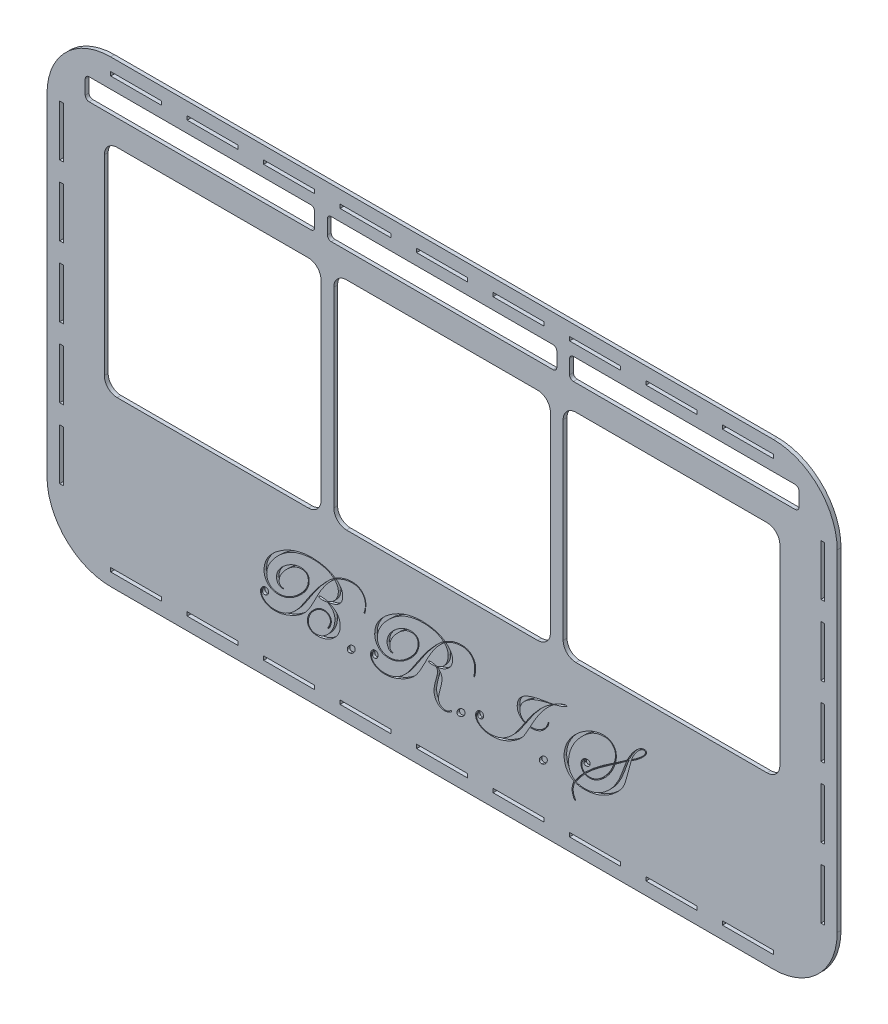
from build123d import *

# Parameters (mm, degrees)
BOSS_EXTRUDE1_DEPTH = 3
CUT_EXTRUDE1_DEPTH  = 3
SKETCH5_W           = 2.8
SKETCH5_H           = 40
SKETCH5_W_2         = 40
SKETCH5_H_2         = 3
CUT_EXTRUDE4_DEPTH  = 3
CUT_EXTRUDE5_DEPTH  = 2


with BuildPart() as part:
    # Sketch1 → Boss-Extrude1 (new body)
    with BuildSketch(Plane.XY):
        with BuildLine():
            Line((260, -180), (-260, -180))
            ThreePointArc((-260, -180), (-295.355339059, -165.355339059), (-310, -130))
            Line((-310, -130), (-310, 130))
            ThreePointArc((-310, 130), (-295.355339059, 165.355339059), (-260, 180))
            Line((-260, 180), (260, 180))
            ThreePointArc((260, 180), (295.355339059, 165.355339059), (310, 130))
            Line((310, 130), (310, -130))
            ThreePointArc((310, -130), (295.355339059, -165.355339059), (260, -180))
        make_face()
    extrude(amount=BOSS_EXTRUDE1_DEPTH)

    # Sketch2 → Cut-Extrude1 (cut)
    with BuildSketch(Plane.XY.offset(3)):
        with BuildLine():
            Line((75, -49), (1.850681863, -49))
            Line((1.850681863, -49), (-4.149318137, -49))
            Line((-4.149318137, -49), (-75, -49))
            ThreePointArc((-75, -49), (-82.071067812, -46.071067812), (-85, -39))
            Line((-85, -39), (-85, 111))
            ThreePointArc((-85, 111), (-82.071067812, 118.071067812), (-75, 121))
            Line((-75, 121), (75, 121))
            ThreePointArc((75, 121), (82.071067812, 118.071067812), (85, 111))
            Line((85, 111), (85, -39))
            ThreePointArc((85, -39), (82.071067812, -46.071067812), (75, -49))
        make_face()
        with BuildLine():
            Line((105, 121), (255, 121))
            ThreePointArc((255, 121), (262.071067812, 118.071067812), (265, 111))
            Line((265, 111), (265, -39))
            ThreePointArc((265, -39), (262.071067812, -46.071067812), (255, -49))
            Line((255, -49), (105, -49))
            ThreePointArc((105, -49), (97.928932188, -46.071067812), (95, -39))
            Line((95, -39), (95, 111))
            ThreePointArc((95, 111), (97.928932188, 118.071067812), (105, 121))
        make_face()
        with BuildLine():
            Line((-105, -49), (-255, -49))
            ThreePointArc((-255, -49), (-262.071067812, -46.071067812), (-265, -39))
            Line((-265, -39), (-265, 111))
            ThreePointArc((-265, 111), (-262.071067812, 118.071067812), (-255, 121))
            Line((-255, 121), (-105, 121))
            ThreePointArc((-105, 121), (-97.928932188, 118.071067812), (-95, 111))
            Line((-95, 111), (-95, -39))
            ThreePointArc((-95, -39), (-97.928932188, -46.071067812), (-105, -49))
        make_face()
        with BuildLine():
            Line((103, 158), (277, 158))
            ThreePointArc((277, 158), (279.121320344, 157.121320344), (280, 155))
            Line((280, 155), (280, 144))
            ThreePointArc((280, 144), (279.121320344, 141.878679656), (277, 141))
            Line((277, 141), (103, 141))
            ThreePointArc((103, 141), (100.878679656, 141.878679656), (100, 144))
            Line((100, 144), (100, 155))
            ThreePointArc((100, 155), (100.878679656, 157.121320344), (103, 158))
        make_face()
        with BuildLine():
            Line((-103, 141), (-277, 141))
            ThreePointArc((-277, 141), (-279.121320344, 141.878679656), (-280, 144))
            Line((-280, 144), (-280, 155))
            ThreePointArc((-280, 155), (-279.121320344, 157.121320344), (-277, 158))
            Line((-277, 158), (-103, 158))
            ThreePointArc((-103, 158), (-100.878679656, 157.121320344), (-100, 155))
            Line((-100, 155), (-100, 144))
            ThreePointArc((-100, 144), (-100.878679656, 141.878679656), (-103, 141))
        make_face()
        with BuildLine():
            Line((87, 141), (-87, 141))
            ThreePointArc((-87, 141), (-89.121320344, 141.878679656), (-90, 144))
            Line((-90, 144), (-90, 155))
            ThreePointArc((-90, 155), (-89.121320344, 157.121320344), (-87, 158))
            Line((-87, 158), (87, 158))
            ThreePointArc((87, 158), (89.121320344, 157.121320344), (90, 155))
            Line((90, 155), (90, 144))
            ThreePointArc((90, 144), (89.121320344, 141.878679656), (87, 141))
        make_face()
    extrude(amount=-CUT_EXTRUDE1_DEPTH, mode=Mode.SUBTRACT)

    # Sketch5 → Cut-Extrude4 (cut)
    with BuildSketch(Plane.XY.offset(3)):
        with Locations((-298.6, 110)):
            Rectangle(SKETCH5_W, SKETCH5_H)
        with Locations((-298.6, 55)):
            Rectangle(SKETCH5_W, SKETCH5_H)
        with Locations((-298.6, 0)):
            Rectangle(SKETCH5_W, SKETCH5_H)
        with Locations((-298.6, -55)):
            Rectangle(SKETCH5_W, SKETCH5_H)
        with Locations((-298.6, -110)):
            Rectangle(SKETCH5_W, SKETCH5_H)
        with Locations((-240, -168.5)):
            Rectangle(SKETCH5_W_2, SKETCH5_H_2)
        with Locations((298.6, -110)):
            Rectangle(SKETCH5_W, SKETCH5_H)
        with Locations((298.6, -55)):
            Rectangle(SKETCH5_W, SKETCH5_H)
        with Locations((298.6, 0)):
            Rectangle(SKETCH5_W, SKETCH5_H)
        with Locations((298.6, 55)):
            Rectangle(SKETCH5_W, SKETCH5_H)
        with Locations((298.6, 110)):
            Rectangle(SKETCH5_W, SKETCH5_H)
        with Locations((-240, 168.5)):
            Rectangle(SKETCH5_W_2, SKETCH5_H_2)
        with Locations((-180, 168.5)):
            Rectangle(SKETCH5_W_2, SKETCH5_H_2)
        with Locations((-120, 168.5)):
            Rectangle(SKETCH5_W_2, SKETCH5_H_2)
        with Locations((-60, 168.5)):
            Rectangle(SKETCH5_W_2, SKETCH5_H_2)
        with Locations((0, 168.5)):
            Rectangle(SKETCH5_W_2, SKETCH5_H_2)
        with Locations((60, 168.5)):
            Rectangle(SKETCH5_W_2, SKETCH5_H_2)
        with Locations((120, 168.5)):
            Rectangle(SKETCH5_W_2, SKETCH5_H_2)
        with Locations((180, 168.5)):
            Rectangle(SKETCH5_W_2, SKETCH5_H_2)
        with Locations((240, 168.5)):
            Rectangle(SKETCH5_W_2, SKETCH5_H_2)
        with Locations((-180, -168.5)):
            Rectangle(SKETCH5_W_2, SKETCH5_H_2)
        with Locations((-120, -168.5)):
            Rectangle(SKETCH5_W_2, SKETCH5_H_2)
        with Locations((-60, -168.5)):
            Rectangle(SKETCH5_W_2, SKETCH5_H_2)
        with Locations((0, -168.5)):
            Rectangle(SKETCH5_W_2, SKETCH5_H_2)
        with Locations((60, -168.5)):
            Rectangle(SKETCH5_W_2, SKETCH5_H_2)
        with Locations((120, -168.5)):
            Rectangle(SKETCH5_W_2, SKETCH5_H_2)
        with Locations((180, -168.5)):
            Rectangle(SKETCH5_W_2, SKETCH5_H_2)
        with Locations((240, -168.5)):
            Rectangle(SKETCH5_W_2, SKETCH5_H_2)
    extrude(amount=-CUT_EXTRUDE4_DEPTH, mode=Mode.SUBTRACT)

    # Sketch6 → Cut-Extrude5 (cut)
    # profile 1 of 7: a face of its own
    with BuildSketch(Plane.XY.offset(3)):
        with BuildLine():
            add(Edge.make_bspline(
                [(-59.803911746, -92.322845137), (-59.820889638, -92.971521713), (-59.856589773, -94.335521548), (-60.097533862, -96.006301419), (-60.304078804, -97.27829063), (-60.484582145, -97.955905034), (-60.6069756, -98.426842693), (-60.787057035, -98.5616037), (-60.845578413, -98.60539722)],
                knots=[0, 0, 0, 0, 1.809143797, 3.804163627, 4.717190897, 5.383278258, 5.79958286, 6, 6, 6, 6], degree=3))
            add(Edge.make_bspline(
                [(-60.845578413, -98.60539722), (-60.954974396, -98.592558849), (-61.17122366, -98.567180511), (-61.207451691, -98.353103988), (-61.225352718, -98.247324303)],
                knots=[0, 0, 0, 0, 1.011758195, 2, 2, 2, 2], degree=3))
            add(Edge.make_bspline(
                [(-61.225352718, -98.247324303), (-61.219173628, -98.203679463), (-61.203994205, -98.096462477), (-61.169720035, -97.993627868), (-61.149397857, -97.932654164)],
                knots=[0, 0, 0, 0, 0.814140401, 2, 2, 2, 2], degree=3))
            add(Edge.make_bspline(
                [(-61.149397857, -97.932654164), (-60.996140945, -97.51213925), (-60.68745725, -96.66515561), (-60.378937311, -95.336837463), (-60.190061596, -93.963164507), (-60.164210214, -93.032375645), (-60.151133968, -92.561560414)],
                knots=[0, 0, 0, 0, 0.976826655, 1.967483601, 2.971904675, 4, 4, 4, 4], degree=3))
            add(Edge.make_bspline(
                [(-60.151133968, -92.561560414), (-60.158903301, -92.195839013), (-60.174032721, -91.483660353), (-60.308594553, -90.441320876), (-60.5242913, -89.45325344), (-60.822405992, -88.513998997), (-61.233399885, -87.643810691), (-61.711762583, -86.816973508), (-62.286992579, -86.052025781), (-62.940995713, -85.342695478), (-63.664297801, -84.705816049), (-64.451461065, -84.145778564), (-65.301058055, -83.678992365), (-66.208890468, -83.301810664), (-67.16447884, -82.99010778), (-68.181738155, -82.793964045), (-69.251046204, -82.655101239), (-69.984992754, -82.640611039), (-70.361637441, -82.633174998)],
                knots=[0, 0, 0, 0, 1.093239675, 2.128893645, 3.136610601, 4.11481664, 5.06813125, 6.008597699, 6.966869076, 7.923613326, 8.889181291, 9.843477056, 10.806801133, 11.781052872, 12.779849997, 13.806485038, 14.874337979, 16, 16, 16, 16], degree=3))
            add(Edge.make_bspline(
                [(-70.361637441, -82.633174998), (-70.879274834, -82.647711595), (-71.920916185, -82.67696358), (-73.488925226, -82.852881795), (-75.067532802, -83.156719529), (-76.653764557, -83.602685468), (-78.262095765, -84.135249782), (-79.871587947, -84.822480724), (-81.499858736, -85.605457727), (-82.561528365, -86.217796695), (-83.100352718, -86.528574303)],
                knots=[0, 0, 0, 0, 0.921542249, 1.854418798, 2.805275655, 3.779966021, 4.785803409, 5.818966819, 6.893070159, 8, 8, 8, 8], degree=3))
            add(Edge.make_bspline(
                [(-83.100352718, -86.528574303), (-82.693059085, -86.847105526), (-81.900782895, -87.466719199), (-80.842383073, -88.485367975), (-79.960523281, -89.55849725), (-79.217072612, -90.659175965), (-78.654195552, -91.811811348), (-78.247140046, -93.003240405), (-77.98408746, -94.231868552), (-77.958910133, -95.070375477), (-77.946272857, -95.491247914)],
                knots=[0, 0, 0, 0, 1.15467319, 2.246094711, 3.273421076, 4.25275653, 5.20676442, 6.129214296, 7.060995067, 8, 8, 8, 8], degree=3))
            add(Edge.make_bspline(
                [(-77.946272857, -95.491247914), (-77.954233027, -95.824469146), (-77.969870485, -96.479069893), (-78.103782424, -97.434655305), (-78.314929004, -98.343497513), (-78.636774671, -99.190637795), (-79.025646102, -99.990942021), (-79.510078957, -100.737837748), (-80.083359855, -101.428091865), (-80.746595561, -102.067073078), (-81.495809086, -102.652314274), (-82.339475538, -103.181559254), (-83.259600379, -103.675101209), (-84.278563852, -104.090928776), (-85.374319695, -104.474088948), (-86.560557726, -104.795966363), (-87.831813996, -105.06927337), (-88.712910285, -105.200340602), (-89.165890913, -105.267723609)],
                knots=[0, 0, 0, 0, 0.969007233, 1.903578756, 2.801964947, 3.677631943, 4.534121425, 5.386398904, 6.260800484, 7.138929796, 8.060916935, 9.021315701, 10.033361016, 11.094542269, 12.219344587, 13.408973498, 14.667926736, 16, 16, 16, 16], degree=3))
            add(Edge.make_bspline(
                [(-89.165890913, -105.267723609), (-88.791351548, -105.400130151), (-88.05933275, -105.658912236), (-87.017682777, -106.123816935), (-86.033762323, -106.602640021), (-85.136904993, -107.150096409), (-84.303887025, -107.726022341), (-83.546275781, -108.34343104), (-82.852765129, -108.999757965), (-82.23703184, -109.69951579), (-81.700753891, -110.447592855), (-81.232402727, -111.231561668), (-80.830867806, -112.054677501), (-80.50166356, -112.918388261), (-80.253749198, -113.827778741), (-80.070986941, -114.774200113), (-79.957644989, -115.764825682), (-79.947827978, -116.436395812), (-79.942800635, -116.780310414)],
                knots=[0, 0, 0, 0, 1.19777242, 2.340987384, 3.438789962, 4.49593944, 5.5068131, 6.491683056, 7.440857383, 8.384056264, 9.298485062, 10.213434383, 11.135640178, 12.057587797, 12.997246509, 13.97508159, 14.963028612, 16, 16, 16, 16], degree=3))
            add(Edge.make_bspline(
                [(-79.942800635, -116.780310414), (-79.959933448, -117.291307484), (-79.993799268, -118.301377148), (-80.250916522, -119.791715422), (-80.675582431, -121.234353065), (-81.27816999, -122.62657324), (-82.041951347, -123.971942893), (-82.986800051, -125.259020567), (-84.101232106, -126.49518492), (-85.358263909, -127.677786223), (-86.730148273, -128.760243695), (-88.17717118, -129.711873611), (-89.686376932, -130.502700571), (-91.241425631, -131.175024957), (-92.863728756, -131.684207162), (-94.542799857, -132.038800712), (-96.277879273, -132.263645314), (-97.455129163, -132.292838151), (-98.052609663, -132.307654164)],
                knots=[0, 0, 0, 0, 0.929922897, 1.83814539, 2.744456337, 3.661798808, 4.59367787, 5.555120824, 6.562372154, 7.619791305, 8.693405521, 9.739881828, 10.767861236, 11.791550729, 12.820310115, 13.857359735, 14.912562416, 16, 16, 16, 16], degree=3))
            add(Edge.make_bspline(
                [(-98.052609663, -132.307654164), (-98.604615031, -132.290776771), (-99.658563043, -132.258552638), (-101.148205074, -131.906641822), (-102.477668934, -131.37507003), (-103.6038127, -130.593516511), (-104.525638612, -129.634218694), (-105.177478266, -128.485546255), (-105.56801742, -127.182029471), (-105.613604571, -126.262983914), (-105.63724508, -125.786386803)],
                knots=[0, 0, 0, 0, 1.172568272, 2.238793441, 3.239484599, 4.202457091, 5.133615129, 6.047333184, 6.9873893, 8, 8, 8, 8], degree=3))
            add(Edge.make_bspline(
                [(-105.63724508, -125.786386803), (-105.625492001, -125.39846543), (-105.601928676, -124.620735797), (-105.384440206, -123.458897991), (-105.033296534, -122.304188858), (-104.549853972, -121.150477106), (-103.94391543, -119.991900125), (-103.171726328, -118.855279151), (-102.279065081, -117.714265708), (-101.277979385, -116.594630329), (-100.203073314, -115.552230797), (-99.106972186, -114.623872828), (-98.00867757, -113.837706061), (-96.907597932, -113.18768527), (-95.800216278, -112.689525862), (-94.693762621, -112.31928948), (-93.579097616, -112.110949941), (-92.834208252, -112.077072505), (-92.464502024, -112.060258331)],
                knots=[0, 0, 0, 0, 0.903195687, 1.810784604, 2.743956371, 3.711214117, 4.721571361, 5.785116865, 6.907919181, 8.095646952, 9.281699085, 10.394237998, 11.439596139, 12.425401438, 13.368416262, 14.263911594, 15.138338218, 16, 16, 16, 16], degree=3))
            add(Edge.make_bspline(
                [(-92.464502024, -112.060258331), (-92.072022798, -112.078378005), (-91.312357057, -112.113449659), (-90.231717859, -112.401999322), (-89.260331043, -112.875421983), (-88.430228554, -113.542778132), (-87.737524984, -114.343502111), (-87.243494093, -115.27449351), (-86.93627088, -116.312702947), (-86.903990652, -117.042114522), (-86.88724508, -117.420501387)],
                knots=[0, 0, 0, 0, 1.085434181, 2.100919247, 3.072897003, 4.056773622, 5.030143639, 5.984573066, 6.954484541, 8, 8, 8, 8], degree=3))
            add(Edge.make_bspline(
                [(-86.88724508, -117.420501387), (-86.898523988, -117.670886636), (-86.922784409, -118.209453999), (-87.112422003, -119.051566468), (-87.398281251, -119.979120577), (-87.768441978, -120.926184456), (-88.165221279, -121.794693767), (-88.532828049, -122.45285155), (-88.859371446, -122.908662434), (-89.128624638, -123.004661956), (-89.23099508, -123.041161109)],
                knots=[0, 0, 0, 0, 0.957405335, 2.059335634, 3.289464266, 4.669568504, 5.951241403, 6.924518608, 7.591100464, 8, 8, 8, 8], degree=3))
            add(Edge.make_bspline(
                [(-89.23099508, -123.041161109), (-89.348870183, -123.035695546), (-89.556317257, -123.026076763), (-89.609505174, -122.831993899), (-89.632470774, -122.748192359)],
                knots=[0, 0, 0, 0, 1.136435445, 2, 2, 2, 2], degree=3))
            add(Edge.make_bspline(
                [(-89.632470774, -122.748192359), (-89.62020314, -122.68597456), (-89.590318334, -122.534407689), (-89.521266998, -122.395846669), (-89.480561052, -122.314164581)],
                knots=[0, 0, 0, 0, 0.820994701, 2, 2, 2, 2], degree=3))
            add(Edge.make_bspline(
                [(-89.480561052, -122.314164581), (-89.188573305, -121.876778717), (-88.63547339, -121.048257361), (-88.05570395, -119.756066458), (-87.658239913, -118.539749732), (-87.606408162, -117.737832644), (-87.581689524, -117.35539722)],
                knots=[0, 0, 0, 0, 1.16966152, 2.215639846, 3.149036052, 4, 4, 4, 4], degree=3))
            add(Edge.make_bspline(
                [(-87.581689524, -117.35539722), (-87.597380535, -117.028084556), (-87.627909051, -116.391263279), (-87.89361183, -115.485954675), (-88.339294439, -114.682496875), (-88.95338052, -113.996913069), (-89.707900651, -113.441135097), (-90.577806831, -113.0365057), (-91.557711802, -112.789744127), (-92.245965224, -112.766728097), (-92.605561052, -112.754702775)],
                knots=[0, 0, 0, 0, 1.024658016, 1.993580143, 2.927630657, 3.883524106, 4.856552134, 5.845833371, 6.874499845, 8, 8, 8, 8], degree=3))
            add(Edge.make_bspline(
                [(-92.605561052, -112.754702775), (-92.957485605, -112.76635706), (-93.667338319, -112.789864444), (-94.725815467, -113.011918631), (-95.782157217, -113.341687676), (-96.82483778, -113.835744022), (-97.862526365, -114.450149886), (-98.886620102, -115.211719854), (-99.910936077, -116.094733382), (-100.906493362, -117.093795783), (-101.837361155, -118.163794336), (-102.668804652, -119.257311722), (-103.362390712, -120.368610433), (-103.944393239, -121.475188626), (-104.395554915, -122.590182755), (-104.712383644, -123.714209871), (-104.901736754, -124.846809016), (-104.929165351, -125.604858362), (-104.942800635, -125.981699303)],
                knots=[0, 0, 0, 0, 0.859747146, 1.734161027, 2.635024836, 3.561203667, 4.548882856, 5.580435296, 6.678145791, 7.854160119, 9.026742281, 10.144936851, 11.210192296, 12.227074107, 13.199581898, 14.146194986, 15.078437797, 16, 16, 16, 16], degree=3))
            add(Edge.make_bspline(
                [(-104.942800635, -125.981699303), (-104.921640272, -126.370734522), (-104.880600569, -127.125253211), (-104.569004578, -128.20877), (-104.033897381, -129.18205196), (-103.305648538, -130.031856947), (-102.431888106, -130.74403783), (-101.422588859, -131.245352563), (-100.317994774, -131.564837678), (-99.545027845, -131.596809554), (-99.148529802, -131.61320972)],
                knots=[0, 0, 0, 0, 1.034211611, 2.005813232, 2.970479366, 3.967346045, 4.966810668, 5.948086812, 6.947458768, 8, 8, 8, 8], degree=3))
            add(Edge.make_bspline(
                [(-99.148529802, -131.61320972), (-98.684551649, -131.595493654), (-97.757202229, -131.560084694), (-96.381325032, -131.304715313), (-95.037444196, -130.872438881), (-93.717649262, -130.289592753), (-92.44297355, -129.512904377), (-91.187642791, -128.58989737), (-89.975039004, -127.480894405), (-88.795461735, -126.240805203), (-87.710430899, -124.896031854), (-86.740370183, -123.502519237), (-85.942729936, -122.060049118), (-85.256429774, -120.598978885), (-84.750819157, -119.089151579), (-84.376570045, -117.554764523), (-84.155627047, -115.983775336), (-84.124916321, -114.925515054), (-84.109467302, -114.393157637)],
                knots=[0, 0, 0, 0, 0.888851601, 1.77654058, 2.670833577, 3.589161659, 4.534094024, 5.525198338, 6.57043752, 7.678384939, 8.801916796, 9.878464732, 10.927259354, 11.956848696, 12.967224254, 13.972452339, 14.980042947, 16, 16, 16, 16], degree=3))
            add(Edge.make_bspline(
                [(-84.109467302, -114.393157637), (-84.123202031, -113.906942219), (-84.149999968, -112.958283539), (-84.444066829, -111.592176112), (-84.902049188, -110.32200657), (-85.545305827, -109.149941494), (-86.385939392, -108.089279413), (-87.398020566, -107.121849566), (-88.600113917, -106.262920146), (-89.496061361, -105.792420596), (-89.957991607, -105.549841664)],
                knots=[0, 0, 0, 0, 1.035953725, 2.021257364, 2.966077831, 3.909036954, 4.860014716, 5.842503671, 6.887643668, 8, 8, 8, 8], degree=3))
            Line((-89.957991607, -105.549841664), (-92.073877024, -105.810258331))
            add(Edge.make_bspline(
                [(-92.073877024, -105.810258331), (-92.366622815, -105.839190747), (-92.951227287, -105.896967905), (-93.538499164, -105.911506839), (-93.831689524, -105.918765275)],
                knots=[0, 0, 0, 0, 1.001517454, 2, 2, 2, 2], degree=3))
            add(Edge.make_bspline(
                [(-93.831689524, -105.918765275), (-94.048727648, -105.912869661), (-94.454316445, -105.901852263), (-95.021230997, -105.866834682), (-95.50189886, -105.781646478), (-95.893489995, -105.661865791), (-96.212551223, -105.528617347), (-96.43870201, -105.339905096), (-96.58562522, -105.110789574), (-96.601517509, -104.940554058), (-96.609467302, -104.85539722)],
                knots=[0, 0, 0, 0, 1.609796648, 3.008298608, 4.207504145, 5.216904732, 6.044704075, 6.748567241, 7.373996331, 8, 8, 8, 8], degree=3))
            add(Edge.make_bspline(
                [(-96.609467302, -104.85539722), (-96.568999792, -104.748010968), (-96.469610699, -104.484267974), (-95.924846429, -104.315755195), (-95.198949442, -104.211201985), (-94.601388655, -104.200000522), (-94.254866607, -104.193504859)],
                knots=[0, 0, 0, 0, 0.509731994, 1.251912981, 2.406400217, 4, 4, 4, 4], degree=3))
            add(Edge.make_bspline(
                [(-94.254866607, -104.193504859), (-93.954381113, -104.203951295), (-93.304477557, -104.226545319), (-92.260889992, -104.354221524), (-91.08016577, -104.560217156), (-90.253665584, -104.753345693), (-89.81693258, -104.85539722)],
                knots=[0, 0, 0, 0, 0.802196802, 1.73502736, 2.803160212, 4, 4, 4, 4], degree=3))
            add(Edge.make_bspline(
                [(-89.81693258, -104.85539722), (-89.193671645, -104.643629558), (-87.975861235, -104.229849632), (-86.321057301, -103.286339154), (-84.866944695, -102.137556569), (-83.638402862, -100.77442656), (-82.651680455, -99.250190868), (-81.933123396, -97.594768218), (-81.495685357, -95.824788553), (-81.44452045, -94.603975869), (-81.41849508, -93.983001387)],
                knots=[0, 0, 0, 0, 1.068090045, 2.086976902, 3.078746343, 4.069556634, 5.056310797, 6.017560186, 6.991618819, 8, 8, 8, 8], degree=3))
            add(Edge.make_bspline(
                [(-81.41849508, -93.983001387), (-81.426681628, -93.678724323), (-81.442839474, -93.078170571), (-81.577031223, -92.186363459), (-81.804303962, -91.321126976), (-82.125907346, -90.476487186), (-82.523815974, -89.652533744), (-83.022185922, -88.852320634), (-83.60267339, -88.071418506), (-84.054002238, -87.587827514), (-84.283078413, -87.342376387)],
                knots=[0, 0, 0, 0, 0.983545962, 1.94123149, 2.908580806, 3.870897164, 4.85950637, 5.862470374, 6.915076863, 8, 8, 8, 8], degree=3))
            add(Edge.make_bspline(
                [(-84.283078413, -87.342376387), (-84.954721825, -87.884706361), (-86.34116578, -89.004214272), (-88.292893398, -90.954461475), (-90.231411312, -93.15185294), (-92.122853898, -95.627089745), (-94.004523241, -98.353929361), (-95.840579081, -101.355048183), (-97.66049859, -104.613675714), (-98.793386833, -106.908130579), (-99.376394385, -108.088904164)],
                knots=[0, 0, 0, 0, 0.800232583, 1.651884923, 2.555119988, 3.516692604, 4.539386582, 5.626862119, 6.778734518, 8, 8, 8, 8], degree=3))
            add(Edge.make_bspline(
                [(-99.376394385, -108.088904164), (-99.73122758, -108.813913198), (-100.419607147, -110.2204372), (-101.47359568, -112.238578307), (-102.499103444, -114.105117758), (-103.510619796, -115.811902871), (-104.494531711, -117.367296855), (-105.463159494, -118.763476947), (-106.384429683, -120.025214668), (-107.039056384, -120.773917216), (-107.351654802, -121.131438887)],
                knots=[0, 0, 0, 0, 1.263502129, 2.451205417, 3.563708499, 4.596864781, 5.556541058, 6.443878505, 7.256918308, 8, 8, 8, 8], degree=3))
            add(Edge.make_bspline(
                [(-107.351654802, -121.131438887), (-107.654430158, -121.458007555), (-108.270647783, -122.122650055), (-109.304211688, -123.052784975), (-110.417429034, -123.969851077), (-111.617171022, -124.879757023), (-112.91602625, -125.752879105), (-114.31457566, -126.59888652), (-115.796025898, -127.435769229), (-116.829455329, -127.960459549), (-117.35599508, -128.227793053)],
                knots=[0, 0, 0, 0, 0.866001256, 1.762512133, 2.702222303, 3.671884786, 4.690653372, 5.745408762, 6.851269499, 8, 8, 8, 8], degree=3))
            add(Edge.make_bspline(
                [(-117.35599508, -128.227793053), (-117.983287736, -128.521607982), (-119.209748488, -129.096064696), (-121.043537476, -129.863759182), (-122.834210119, -130.486234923), (-124.566484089, -131.014223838), (-126.249461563, -131.431829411), (-127.884236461, -131.722805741), (-129.468284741, -131.908485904), (-130.506553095, -131.928761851), (-131.017019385, -131.938730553)],
                knots=[0, 0, 0, 0, 1.164749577, 2.277277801, 3.340990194, 4.351122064, 5.321738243, 6.254675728, 7.141908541, 8, 8, 8, 8], degree=3))
            add(Edge.make_bspline(
                [(-131.017019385, -131.938730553), (-131.418800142, -131.933868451), (-132.205826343, -131.924344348), (-133.357697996, -131.808997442), (-134.458115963, -131.642578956), (-135.504100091, -131.386677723), (-136.505233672, -131.078387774), (-137.450272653, -130.683838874), (-138.34827656, -130.226235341), (-139.185779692, -129.702686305), (-139.942973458, -129.118311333), (-140.608717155, -128.498147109), (-141.184204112, -127.847389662), (-141.635349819, -127.147203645), (-142.007612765, -126.424679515), (-142.251705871, -125.657638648), (-142.410679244, -124.859754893), (-142.432006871, -124.315080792), (-142.442800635, -124.039424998)],
                knots=[0, 0, 0, 0, 1.251903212, 2.452284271, 3.605187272, 4.718148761, 5.805694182, 6.86721517, 7.905919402, 8.944440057, 9.941179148, 10.882430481, 11.777583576, 12.640637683, 13.472570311, 14.303279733, 15.141301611, 16, 16, 16, 16], degree=3))
            add(Edge.make_bspline(
                [(-142.442800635, -124.039424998), (-142.429192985, -123.734093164), (-142.402700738, -123.139653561), (-142.164733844, -122.27925359), (-141.768864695, -121.494694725), (-141.236765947, -120.78761679), (-140.59583308, -120.200299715), (-139.884109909, -119.74921533), (-139.096406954, -119.488774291), (-138.552863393, -119.455613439), (-138.276133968, -119.438730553)],
                knots=[0, 0, 0, 0, 1.063913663, 2.071295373, 3.087337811, 4.11476265, 5.142109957, 6.105433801, 7.035436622, 8, 8, 8, 8], degree=3))
            add(Edge.make_bspline(
                [(-138.276133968, -119.438730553), (-138.112844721, -119.448129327), (-137.804033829, -119.465904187), (-137.367528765, -119.569815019), (-136.995025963, -119.770082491), (-136.700729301, -120.061361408), (-136.462417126, -120.421688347), (-136.305911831, -120.864292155), (-136.208181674, -121.380322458), (-136.198132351, -121.749416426), (-136.192800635, -121.94524097)],
                knots=[0, 0, 0, 0, 1.052336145, 1.990166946, 2.865763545, 3.738877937, 4.630440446, 5.62553516, 6.740216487, 8, 8, 8, 8], degree=3))
            add(Edge.make_bspline(
                [(-136.192800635, -121.94524097), (-136.202958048, -122.148958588), (-136.22267016, -122.544305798), (-136.385253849, -123.112821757), (-136.631266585, -123.641614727), (-136.99025744, -124.100368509), (-137.414879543, -124.485175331), (-137.89514002, -124.774159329), (-138.431637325, -124.942800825), (-138.803043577, -124.962531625), (-138.992279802, -124.97258472)],
                knots=[0, 0, 0, 0, 1.064377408, 2.065597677, 3.073240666, 4.099386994, 5.091437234, 6.05897959, 7.011025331, 8, 8, 8, 8], degree=3))
            add(Edge.make_bspline(
                [(-138.992279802, -124.97258472), (-139.152088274, -124.967486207), (-139.453402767, -124.9578731), (-139.871213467, -124.857106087), (-140.229542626, -124.707904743), (-140.523733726, -124.488007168), (-140.732660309, -124.188210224), (-140.887827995, -123.839571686), (-140.960387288, -123.423780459), (-140.957692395, -123.131760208), (-140.956255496, -122.976056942)],
                knots=[0, 0, 0, 0, 1.181241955, 2.227199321, 3.16273203, 4.041319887, 4.903838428, 5.839371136, 6.847966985, 8, 8, 8, 8], degree=3))
            add(Edge.make_bspline(
                [(-140.956255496, -122.976056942), (-140.954852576, -122.85951331), (-140.952393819, -122.655258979), (-140.965462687, -122.409513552), (-141.007275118, -122.226025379), (-141.086873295, -122.18832812), (-141.119015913, -122.173105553)],
                knots=[0, 0, 0, 0, 1.611166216, 2.823729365, 3.52500901, 4, 4, 4, 4], degree=3))
            add(Edge.make_bspline(
                [(-141.119015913, -122.173105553), (-141.218076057, -122.202805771), (-141.456663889, -122.274339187), (-141.6215072, -122.735719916), (-141.732331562, -123.341053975), (-141.742467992, -123.837719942), (-141.748356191, -124.126230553)],
                knots=[0, 0, 0, 0, 0.540971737, 1.302938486, 2.433291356, 4, 4, 4, 4], degree=3))
            add(Edge.make_bspline(
                [(-141.748356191, -124.126230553), (-141.741027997, -124.376454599), (-141.72656752, -124.870213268), (-141.580828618, -125.594112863), (-141.338007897, -126.281267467), (-141.012220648, -126.941647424), (-140.578084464, -127.560491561), (-140.071607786, -128.162855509), (-139.453363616, -128.717172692), (-138.751401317, -129.22947403), (-137.986013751, -129.708443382), (-137.159419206, -130.117537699), (-136.285994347, -130.469544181), (-135.361350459, -130.744417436), (-134.396369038, -130.980598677), (-133.378424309, -131.123022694), (-132.314053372, -131.227829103), (-131.585157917, -131.238717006), (-131.212331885, -131.244286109)],
                knots=[0, 0, 0, 0, 0.851540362, 1.680315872, 2.502471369, 3.328954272, 4.179870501, 5.071212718, 6.004402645, 6.99992485, 8.029035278, 9.075913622, 10.137478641, 11.232616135, 12.359249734, 13.517964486, 14.730452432, 16, 16, 16, 16], degree=3))
            add(Edge.make_bspline(
                [(-131.212331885, -131.244286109), (-130.549660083, -131.223622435), (-129.233299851, -131.182575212), (-127.282457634, -130.911274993), (-125.383610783, -130.431566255), (-123.522157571, -129.803242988), (-121.724068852, -128.946426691), (-119.957670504, -127.942717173), (-118.250247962, -126.729822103), (-117.175429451, -125.809429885), (-116.628998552, -125.341508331)],
                knots=[0, 0, 0, 0, 0.987660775, 1.961932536, 2.928102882, 3.903209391, 4.884731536, 5.891666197, 6.928136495, 8, 8, 8, 8], degree=3))
            add(Edge.make_bspline(
                [(-116.628998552, -125.341508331), (-116.168444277, -124.916034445), (-115.258699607, -124.075584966), (-113.993950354, -122.74416801), (-112.804019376, -121.399108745), (-111.969674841, -120.347460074), (-111.412415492, -119.601242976), (-111.094280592, -119.147393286), (-110.718279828, -118.635264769), (-110.308956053, -118.053246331), (-109.866683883, -117.3954203), (-109.364391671, -116.686442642), (-108.831804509, -115.899651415), (-108.262950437, -115.045489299), (-107.637208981, -114.131684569), (-106.979577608, -113.145014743), (-106.273840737, -112.092797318), (-105.522302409, -110.973452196), (-104.735285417, -109.786122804), (-103.906998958, -108.528678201), (-103.028466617, -107.213042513), (-102.43553059, -106.306274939), (-102.132470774, -105.842810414)],
                knots=[0, 0, 0, 0, 1.543624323, 3.049160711, 4.519617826, 5.964853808, 6.353186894, 6.812893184, 7.32955441, 7.917661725, 8.564910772, 9.281437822, 10.057133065, 10.904433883, 11.80857732, 12.784330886, 13.82431087, 14.928517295, 16.104360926, 17.332087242, 18.636383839, 20, 20, 20, 20], degree=3))
            add(Edge.make_bspline(
                [(-102.132470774, -105.842810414), (-101.503887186, -104.929178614), (-100.222824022, -103.067182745), (-98.111891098, -100.330572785), (-95.854336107, -97.542823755), (-93.821027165, -95.268613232), (-92.181320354, -93.471493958), (-90.973438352, -92.226217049), (-89.824085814, -91.07493925), (-88.73244629, -90.02086141), (-87.687599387, -89.075840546), (-86.699531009, -88.225228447), (-85.762265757, -87.473981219), (-85.135187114, -87.032061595), (-84.83646383, -86.821543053)],
                knots=[0, 0, 0, 0, 1.546156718, 3.151091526, 4.817908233, 6.547349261, 7.404023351, 8.210151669, 8.96622442, 9.672511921, 10.32594843, 10.930447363, 11.490494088, 12, 12, 12, 12], degree=3))
            add(Edge.make_bspline(
                [(-84.83646383, -86.821543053), (-85.334742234, -86.430356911), (-86.346239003, -85.63625563), (-88.041617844, -84.640174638), (-89.898925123, -83.811000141), (-91.906621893, -83.10710237), (-94.085594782, -82.5852619), (-96.421582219, -82.210226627), (-98.91962355, -81.978562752), (-100.638173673, -81.952287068), (-101.524831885, -81.938730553)],
                knots=[0, 0, 0, 0, 0.856011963, 1.737689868, 2.650566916, 3.603492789, 4.610725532, 5.676241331, 6.801094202, 8, 8, 8, 8], degree=3))
            add(Edge.make_bspline(
                [(-101.524831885, -81.938730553), (-102.161622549, -81.946923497), (-103.422083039, -81.963140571), (-105.297911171, -82.097304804), (-107.139821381, -82.316901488), (-108.956498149, -82.603023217), (-110.737391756, -82.997090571), (-112.487569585, -83.479289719), (-114.210961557, -84.026370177), (-115.902943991, -84.670518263), (-117.55530892, -85.408214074), (-119.181194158, -86.226312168), (-120.775839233, -87.125734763), (-122.339629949, -88.115223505), (-123.871818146, -89.190206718), (-125.369730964, -90.357999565), (-126.848677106, -91.597020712), (-127.788160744, -92.491300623), (-128.260942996, -92.94133472)],
                knots=[0, 0, 0, 0, 1.029777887, 2.038337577, 3.039610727, 4.029162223, 5.011321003, 5.987626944, 6.964370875, 7.93450656, 8.913891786, 9.889654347, 10.877128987, 11.873554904, 12.881333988, 13.902788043, 14.944606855, 16, 16, 16, 16], degree=3))
            add(Edge.make_bspline(
                [(-128.260942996, -92.94133472), (-128.998038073, -93.676862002), (-130.42347346, -95.099265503), (-132.320755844, -97.310976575), (-133.934151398, -99.490715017), (-135.25331668, -101.637662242), (-136.292447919, -103.752509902), (-137.023799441, -105.842765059), (-137.501068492, -107.900965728), (-137.555193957, -109.27282071), (-137.581689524, -109.944372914)],
                knots=[0, 0, 0, 0, 1.255676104, 2.428296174, 3.511194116, 4.523561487, 5.464066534, 6.347143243, 7.190891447, 8, 8, 8, 8], degree=3))
            add(Edge.make_bspline(
                [(-137.581689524, -109.944372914), (-137.573014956, -110.273880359), (-137.556178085, -110.913436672), (-137.434682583, -111.851316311), (-137.231184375, -112.734644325), (-136.945980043, -113.571679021), (-136.582017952, -114.355421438), (-136.111353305, -115.076809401), (-135.587955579, -115.761525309), (-134.974723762, -116.383371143), (-134.287610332, -116.935659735), (-133.544612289, -117.423452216), (-132.735169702, -117.830722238), (-131.873248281, -118.162165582), (-130.951502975, -118.427602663), (-129.973196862, -118.603449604), (-128.940733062, -118.733026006), (-128.232444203, -118.740476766), (-127.870317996, -118.744286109)],
                knots=[0, 0, 0, 0, 1.068033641, 2.072996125, 3.059944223, 4.001772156, 4.935389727, 5.85266587, 6.788489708, 7.725414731, 8.675816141, 9.641714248, 10.601329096, 11.607317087, 12.631655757, 13.705594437, 14.826941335, 16, 16, 16, 16], degree=3))
            add(Edge.make_bspline(
                [(-127.870317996, -118.744286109), (-127.25767406, -118.722879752), (-126.016767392, -118.679521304), (-124.153673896, -118.336907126), (-122.277640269, -117.791894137), (-120.391645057, -117.019832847), (-118.485908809, -116.041307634), (-116.578690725, -114.82137037), (-114.642404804, -113.41010393), (-112.741768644, -111.808468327), (-110.94774035, -110.116785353), (-109.347735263, -108.397820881), (-107.997610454, -106.686728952), (-106.889771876, -104.985161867), (-106.016545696, -103.298803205), (-105.40850322, -101.616945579), (-105.010023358, -99.947773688), (-104.965044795, -98.8317876), (-104.942800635, -98.279876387)],
                knots=[0, 0, 0, 0, 0.888687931, 1.800032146, 2.740291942, 3.719949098, 4.75294673, 5.845223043, 7.002268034, 8.228196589, 9.449847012, 10.579123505, 11.633441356, 12.608983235, 13.522215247, 14.382400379, 15.200015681, 16, 16, 16, 16], degree=3))
            add(Edge.make_bspline(
                [(-104.942800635, -98.279876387), (-104.95804434, -97.869692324), (-104.986833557, -97.095019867), (-105.236920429, -96.012324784), (-105.647888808, -95.083222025), (-106.247297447, -94.322581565), (-107.029257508, -93.743879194), (-107.969208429, -93.329556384), (-109.076867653, -93.098190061), (-109.864311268, -93.066581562), (-110.281342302, -93.049841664)],
                knots=[0, 0, 0, 0, 1.14827098, 2.16862132, 3.093917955, 3.974086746, 4.849867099, 5.793634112, 6.831506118, 8, 8, 8, 8], degree=3))
            add(Edge.make_bspline(
                [(-110.281342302, -93.049841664), (-110.730967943, -93.071335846), (-111.648703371, -93.115207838), (-113.036506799, -93.394851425), (-114.439088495, -93.873770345), (-115.871715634, -94.515975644), (-117.314945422, -95.362744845), (-118.782946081, -96.391798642), (-120.280096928, -97.598854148), (-121.760090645, -98.959813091), (-123.16551016, -100.387909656), (-124.411938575, -101.835878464), (-125.466930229, -103.263460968), (-126.33332598, -104.670847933), (-127.017037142, -106.051502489), (-127.502297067, -107.419726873), (-127.79674852, -108.770780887), (-127.838864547, -109.668149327), (-127.859467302, -110.107133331)],
                knots=[0, 0, 0, 0, 0.822220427, 1.678242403, 2.577520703, 3.527691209, 4.544050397, 5.631971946, 6.803218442, 8.057746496, 9.306421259, 10.464901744, 11.548230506, 12.548628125, 13.483274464, 14.359670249, 15.197566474, 16, 16, 16, 16], degree=3))
            add(Edge.make_bspline(
                [(-127.859467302, -110.107133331), (-127.849878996, -110.314600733), (-127.831060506, -110.721786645), (-127.657214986, -111.304412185), (-127.397948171, -111.853073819), (-127.013645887, -112.325198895), (-126.584633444, -112.746228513), (-126.078151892, -113.024193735), (-125.553048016, -113.229936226), (-125.181330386, -113.245851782), (-124.994883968, -113.25383472)],
                knots=[0, 0, 0, 0, 1.054944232, 2.070486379, 3.07644376, 4.127514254, 5.15817367, 6.116365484, 7.055205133, 8, 8, 8, 8], degree=3))
            add(Edge.make_bspline(
                [(-124.994883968, -113.25383472), (-124.827775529, -113.268150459), (-124.581693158, -113.289231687), (-124.434487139, -113.476010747), (-124.38724508, -113.535952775)],
                knots=[0, 0, 0, 0, 1.358150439, 2, 2, 2, 2], degree=3))
            add(Edge.make_bspline(
                [(-124.38724508, -113.535952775), (-124.399907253, -113.586789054), (-124.426943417, -113.695334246), (-124.609024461, -113.79671343), (-124.859771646, -113.853417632), (-125.062770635, -113.858534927), (-125.179345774, -113.861473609)],
                knots=[0, 0, 0, 0, 0.651072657, 1.390164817, 2.501263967, 4, 4, 4, 4], degree=3))
            add(Edge.make_bspline(
                [(-125.179345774, -113.861473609), (-125.503837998, -113.844247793), (-126.138049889, -113.810580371), (-127.045036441, -113.496566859), (-127.873623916, -113.002411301), (-128.590628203, -112.309994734), (-129.201315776, -111.498945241), (-129.624439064, -110.56390904), (-129.897860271, -109.55113403), (-129.927555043, -108.843060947), (-129.942800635, -108.479529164)],
                knots=[0, 0, 0, 0, 0.971426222, 1.898628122, 2.848448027, 3.847169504, 4.872344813, 5.878067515, 6.910578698, 8, 8, 8, 8], degree=3))
            add(Edge.make_bspline(
                [(-129.942800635, -108.479529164), (-129.923933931, -108.015067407), (-129.886120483, -107.08417344), (-129.577645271, -105.695239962), (-129.069194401, -104.320934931), (-128.372278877, -102.950087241), (-127.466114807, -101.597522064), (-126.376352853, -100.250897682), (-125.08744283, -98.911855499), (-123.623738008, -97.621375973), (-122.069023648, -96.396724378), (-120.461822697, -95.326376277), (-118.852659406, -94.398238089), (-117.218394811, -93.667926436), (-115.587603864, -93.068168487), (-113.940268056, -92.655021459), (-112.281576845, -92.411192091), (-111.171882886, -92.373980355), (-110.61771383, -92.35539722)],
                knots=[0, 0, 0, 0, 0.816461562, 1.636386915, 2.489869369, 3.389088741, 4.335001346, 5.348601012, 6.433152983, 7.60041074, 8.779041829, 9.912012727, 10.994827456, 12.042756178, 13.057154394, 14.047908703, 15.025146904, 16, 16, 16, 16], degree=3))
            add(Edge.make_bspline(
                [(-110.61771383, -92.35539722), (-110.117245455, -92.368845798), (-109.176532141, -92.394124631), (-107.859920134, -92.663299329), (-106.745848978, -93.117786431), (-105.813530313, -93.747063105), (-105.105292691, -94.588533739), (-104.599523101, -95.607029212), (-104.293160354, -96.80119427), (-104.263819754, -97.655837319), (-104.248356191, -98.106265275)],
                knots=[0, 0, 0, 0, 1.221213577, 2.295473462, 3.261836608, 4.144097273, 5.015140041, 5.915960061, 6.901635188, 8, 8, 8, 8], degree=3))
            add(Edge.make_bspline(
                [(-104.248356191, -98.106265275), (-104.274533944, -98.694219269), (-104.327420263, -99.882049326), (-104.729532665, -101.655036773), (-105.364609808, -103.430488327), (-106.270255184, -105.204155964), (-107.416955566, -106.986757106), (-108.816407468, -108.772597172), (-110.479200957, -110.549426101), (-112.341632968, -112.299592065), (-114.316355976, -113.954673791), (-116.335792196, -115.413583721), (-118.351688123, -116.649178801), (-120.359367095, -117.666166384), (-122.365879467, -118.452723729), (-124.358855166, -119.023006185), (-126.349378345, -119.377474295), (-127.677222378, -119.418399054), (-128.336897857, -119.438730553)],
                knots=[0, 0, 0, 0, 0.812335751, 1.641143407, 2.50161565, 3.414065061, 4.387870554, 5.428212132, 6.54640658, 7.749180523, 8.959942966, 10.106318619, 11.190379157, 12.225829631, 13.213898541, 14.165257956, 15.088496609, 16, 16, 16, 16], degree=3))
            add(Edge.make_bspline(
                [(-128.336897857, -119.438730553), (-128.756898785, -119.431824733), (-129.574116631, -119.418387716), (-130.76862917, -119.272314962), (-131.899315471, -119.037630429), (-132.966468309, -118.698756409), (-133.969168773, -118.274142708), (-134.914628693, -117.76539631), (-135.781185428, -117.140129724), (-136.583880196, -116.43497136), (-137.316012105, -115.656197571), (-137.941937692, -114.795515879), (-138.480725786, -113.877638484), (-138.915186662, -112.894333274), (-139.253556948, -111.846902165), (-139.484328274, -110.736945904), (-139.648545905, -109.565841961), (-139.659429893, -108.762258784), (-139.665022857, -108.349320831)],
                knots=[0, 0, 0, 0, 1.126279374, 2.191460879, 3.222961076, 4.220350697, 5.18997642, 6.140972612, 7.094144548, 8.04988143, 9.004238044, 9.955234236, 10.898875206, 11.854562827, 12.833466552, 13.845987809, 14.893115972, 16, 16, 16, 16], degree=3))
            add(Edge.make_bspline(
                [(-139.665022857, -108.349320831), (-139.657762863, -107.92570155), (-139.643264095, -107.079701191), (-139.492156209, -105.818621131), (-139.270964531, -104.569255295), (-138.938703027, -103.338348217), (-138.525069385, -102.120896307), (-138.029138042, -100.913514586), (-137.42253406, -99.724973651), (-136.735625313, -98.547417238), (-135.940845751, -97.392750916), (-135.07920804, -96.239572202), (-134.106116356, -95.110215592), (-133.041177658, -93.995300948), (-131.892621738, -92.88812959), (-130.649408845, -91.799833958), (-129.313697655, -90.729471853), (-127.428923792, -89.315854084), (-124.96088881, -87.6876124), (-121.894794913, -85.964508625), (-118.749599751, -84.505621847), (-115.529861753, -83.305983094), (-112.227572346, -82.37638034), (-108.846478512, -81.738211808), (-105.391244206, -81.313116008), (-103.05967176, -81.267373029), (-101.882904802, -81.244286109)],
                knots=[0, 0, 0, 0, 0.600617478, 1.199479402, 1.799241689, 2.399069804, 3.00585679, 3.622305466, 4.248687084, 4.897181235, 5.55460443, 6.235935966, 6.938213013, 7.667626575, 8.422348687, 9.200357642, 10.010422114, 10.849770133, 12.541656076, 14.200065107, 15.834404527, 17.454500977, 19.069047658, 20.694051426, 22.331456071, 24, 24, 24, 24], degree=3))
            add(Edge.make_bspline(
                [(-101.882904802, -81.244286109), (-101.007097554, -81.258321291), (-99.284990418, -81.285918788), (-96.751593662, -81.519862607), (-94.318326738, -81.894220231), (-91.987028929, -82.428269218), (-89.752613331, -83.10749232), (-87.627985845, -83.960587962), (-85.591925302, -84.940805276), (-84.320201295, -85.725235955), (-83.686290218, -86.116247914)],
                knots=[0, 0, 0, 0, 1.100095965, 2.163127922, 3.193322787, 4.190893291, 5.16539855, 6.123945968, 7.064851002, 8, 8, 8, 8], degree=3))
            add(Edge.make_bspline(
                [(-83.686290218, -86.116247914), (-83.133323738, -85.783469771), (-82.047960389, -85.130292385), (-80.381815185, -84.292370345), (-78.742371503, -83.549587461), (-77.102744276, -82.969419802), (-75.483226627, -82.508431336), (-73.876831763, -82.180413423), (-72.283831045, -81.977604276), (-71.223030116, -81.951600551), (-70.698008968, -81.938730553)],
                knots=[0, 0, 0, 0, 1.120306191, 2.198938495, 3.236504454, 4.243723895, 5.216029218, 6.158335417, 7.088506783, 8, 8, 8, 8], degree=3))
            add(Edge.make_bspline(
                [(-70.698008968, -81.938730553), (-70.299826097, -81.946960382), (-69.519338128, -81.963091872), (-68.37471883, -82.092811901), (-67.289319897, -82.320920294), (-66.264156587, -82.634939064), (-65.303442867, -83.036781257), (-64.407187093, -83.530655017), (-63.563326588, -84.10739667), (-62.791157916, -84.779521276), (-62.080658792, -85.513150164), (-61.471835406, -86.320329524), (-60.960476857, -87.185117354), (-60.532438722, -88.0989749), (-60.207990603, -89.075922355), (-59.969243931, -90.107023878), (-59.825262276, -91.19752925), (-59.811125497, -91.942632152), (-59.803911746, -92.322845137)],
                knots=[0, 0, 0, 0, 1.127102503, 2.209261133, 3.255557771, 4.262846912, 5.240341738, 6.19811562, 7.155287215, 8.12821265, 9.0914446, 10.041690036, 10.982955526, 11.931268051, 12.892974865, 13.891482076, 14.924060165, 16, 16, 16, 16], degree=3))
        make_face()
    # profile 2 of 7: a face of its own
    with BuildSketch(Plane.XY.offset(3)):
        with BuildLine():
            add(Edge.make_bspline(
                [(-68.13724508, -126.73039722), (-68.157944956, -126.996647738), (-68.199828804, -127.535375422), (-68.490761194, -128.329223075), (-68.969220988, -129.09453393), (-69.610667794, -129.799231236), (-70.315859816, -130.43958638), (-71.091065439, -130.880484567), (-71.860287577, -131.198263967), (-72.391423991, -131.229172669), (-72.651133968, -131.244286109)],
                knots=[0, 0, 0, 0, 0.920938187, 1.863413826, 2.89202577, 4.027489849, 5.154708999, 6.170437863, 7.105398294, 8, 8, 8, 8], degree=3))
            add(Edge.make_bspline(
                [(-72.651133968, -131.244286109), (-72.909081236, -131.229744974), (-73.379737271, -131.203212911), (-73.99401073, -130.851051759), (-74.346171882, -130.2367783), (-74.372703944, -129.766122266), (-74.38724508, -129.508174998)],
                knots=[0, 0, 0, 0, 1.096117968, 2, 2.903882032, 4, 4, 4, 4], degree=3))
            add(Edge.make_bspline(
                [(-74.38724508, -129.508174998), (-74.366360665, -129.256248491), (-74.32306473, -128.733974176), (-74.020145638, -127.964939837), (-73.53854256, -127.207117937), (-72.900906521, -126.484297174), (-72.178713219, -125.845748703), (-71.416596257, -125.361382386), (-70.647555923, -125.058467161), (-70.125282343, -125.015170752), (-69.873356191, -124.994286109)],
                knots=[0, 0, 0, 0, 0.876094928, 1.816251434, 2.839873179, 3.991118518, 5.160126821, 6.183748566, 7.123905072, 8, 8, 8, 8], degree=3))
            add(Edge.make_bspline(
                [(-69.873356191, -124.994286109), (-69.615408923, -125.008827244), (-69.144752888, -125.035359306), (-68.53047943, -125.387520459), (-68.178318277, -126.001793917), (-68.151786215, -126.472449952), (-68.13724508, -126.73039722)],
                knots=[0, 0, 0, 0, 1.096117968, 2, 2.903882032, 4, 4, 4, 4], degree=3))
        make_face()
    # profile 3 of 7: a face of its own
    with BuildSketch(Plane.XY.offset(3)):
        with BuildLine():
            add(Edge.make_bspline(
                [(26.307199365, -92.333695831), (26.290045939, -92.982351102), (26.253881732, -94.349897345), (26.014349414, -96.024466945), (25.807007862, -97.299988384), (25.626532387, -97.977606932), (25.504135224, -98.448544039), (25.324054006, -98.583305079), (25.265532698, -98.627098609)],
                knots=[0, 0, 0, 0, 1.806128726, 3.807823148, 4.719328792, 5.38430607, 5.799916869, 6, 6, 6, 6], degree=3))
            add(Edge.make_bspline(
                [(25.265532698, -98.627098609), (25.160642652, -98.609014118), (24.950862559, -98.572845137), (24.914693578, -98.363065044), (24.896609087, -98.258174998)],
                knots=[0, 0, 0, 0, 1, 2, 2, 2, 2], degree=3))
            add(Edge.make_bspline(
                [(24.896609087, -98.258174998), (24.902524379, -98.210861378), (24.916408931, -98.099805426), (24.952086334, -97.993607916), (24.972563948, -97.932654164)],
                knots=[0, 0, 0, 0, 0.852068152, 2, 2, 2, 2], degree=3))
            add(Edge.make_bspline(
                [(24.972563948, -97.932654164), (25.073225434, -97.510773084), (25.276629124, -96.658290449), (25.462779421, -95.336440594), (25.587068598, -93.967312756), (25.604091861, -93.035669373), (25.61275492, -92.561560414)],
                knots=[0, 0, 0, 0, 0.959358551, 1.938547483, 2.95093646, 4, 4, 4, 4], degree=3))
            add(Edge.make_bspline(
                [(25.61275492, -92.561560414), (25.605010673, -92.195827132), (25.589930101, -91.483625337), (25.455019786, -90.441450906), (25.240585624, -89.452785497), (24.938411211, -88.517104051), (24.544554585, -87.640485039), (24.060584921, -86.821211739), (23.500489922, -86.04782129), (22.843859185, -85.347349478), (22.132377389, -84.701289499), (21.347965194, -84.152915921), (20.515856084, -83.675459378), (19.619876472, -83.302484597), (18.675635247, -82.989926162), (17.668993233, -82.793987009), (16.614138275, -82.655544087), (15.891019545, -82.640738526), (15.521609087, -82.633174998)],
                knots=[0, 0, 0, 0, 1.100191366, 2.142430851, 3.156555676, 4.14098193, 5.095840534, 6.04228722, 7.000180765, 7.96300876, 8.926574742, 9.886938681, 10.83738252, 11.807809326, 12.802591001, 13.825092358, 14.888932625, 16, 16, 16, 16], degree=3))
            add(Edge.make_bspline(
                [(15.521609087, -82.633174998), (15.000152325, -82.641749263), (13.950339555, -82.659011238), (12.37817979, -82.8594842), (10.797614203, -83.142717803), (9.221346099, -83.578387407), (7.632400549, -84.108389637), (6.035223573, -84.759396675), (4.440974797, -85.543454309), (3.398313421, -86.139554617), (2.869699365, -86.441768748)],
                knots=[0, 0, 0, 0, 0.935239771, 1.882853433, 2.840198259, 3.814814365, 4.814420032, 5.844988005, 6.90744046, 8, 8, 8, 8], degree=3))
            add(Edge.make_bspline(
                [(2.869699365, -86.441768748), (3.295128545, -86.793168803), (4.119019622, -87.473694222), (5.21955898, -88.570962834), (6.148417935, -89.694576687), (6.922317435, -90.836554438), (7.506862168, -92.014887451), (7.942567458, -93.209673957), (8.197608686, -94.431569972), (8.23368781, -95.255034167), (8.251643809, -95.664859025)],
                knots=[0, 0, 0, 0, 1.197023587, 2.318169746, 3.366384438, 4.35690976, 5.304683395, 6.213362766, 7.110819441, 8, 8, 8, 8], degree=3))
            add(Edge.make_bspline(
                [(8.251643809, -95.664859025), (8.240485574, -96.008987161), (8.218412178, -96.689746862), (8.064383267, -97.694810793), (7.804497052, -98.658648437), (7.442224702, -99.583918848), (6.971253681, -100.467638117), (6.394135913, -101.313258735), (5.717244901, -102.119262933), (4.946053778, -102.877283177), (4.088952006, -103.581447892), (3.156316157, -104.221000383), (2.15415779, -104.787184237), (1.081535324, -105.275340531), (-0.059071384, -105.702045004), (-1.277045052, -106.041405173), (-2.557943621, -106.330953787), (-3.440654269, -106.453256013), (-3.890283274, -106.51555347)],
                knots=[0, 0, 0, 0, 0.92374447, 1.82736587, 2.722442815, 3.598783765, 4.489266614, 5.404963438, 6.342386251, 7.310536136, 8.303921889, 9.316624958, 10.342785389, 11.389910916, 12.477538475, 13.608598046, 14.781884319, 16, 16, 16, 16], degree=3))
            add(Edge.make_bspline(
                [(-3.890283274, -106.51555347), (-3.589771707, -106.705018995), (-3.004350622, -107.074113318), (-2.211465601, -107.712942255), (-1.558514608, -108.436939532), (-1.019267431, -109.217677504), (-0.589121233, -110.05404028), (-0.299537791, -110.963887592), (-0.105355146, -111.928988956), (-0.089677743, -112.598184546), (-0.081689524, -112.939164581)],
                knots=[0, 0, 0, 0, 1.084722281, 2.113127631, 3.098561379, 4.051631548, 5.005213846, 5.958988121, 6.960028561, 8, 8, 8, 8], degree=3))
            add(Edge.make_bspline(
                [(-0.081689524, -112.939164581), (-0.084737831, -113.188981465), (-0.091204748, -113.718962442), (-0.191101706, -114.554236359), (-0.321477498, -115.480199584), (-0.492139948, -116.502732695), (-0.73329001, -117.612692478), (-1.032953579, -118.811206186), (-1.365449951, -120.104616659), (-1.620296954, -120.99459387), (-1.752696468, -121.45695972)],
                knots=[0, 0, 0, 0, 0.688427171, 1.460482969, 2.31659545, 3.267542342, 4.317933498, 5.447528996, 6.673926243, 8, 8, 8, 8], degree=3))
            add(Edge.make_bspline(
                [(-1.752696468, -121.45695972), (-1.923908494, -122.04810087), (-2.24440021, -123.15465773), (-2.569602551, -124.738071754), (-2.817783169, -126.111459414), (-2.846394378, -126.96825414), (-2.859467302, -127.359737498)],
                knots=[0, 0, 0, 0, 1.225515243, 2.294041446, 3.220519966, 4, 4, 4, 4], degree=3))
            add(Edge.make_bspline(
                [(-2.859467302, -127.359737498), (-2.841333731, -127.716356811), (-2.805938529, -128.412447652), (-2.508319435, -129.410515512), (-2.041790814, -130.330041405), (-1.369888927, -131.12107806), (-0.5899417, -131.802961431), (0.31371545, -132.281439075), (1.299391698, -132.580489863), (1.984974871, -132.615266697), (2.338015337, -132.633174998)],
                knots=[0, 0, 0, 0, 1.036625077, 2.023404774, 3.00804578, 4.018217, 5.027069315, 6.007305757, 6.973863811, 8, 8, 8, 8], degree=3))
            add(Edge.make_bspline(
                [(2.338015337, -132.633174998), (2.709431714, -132.612416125), (3.455731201, -132.570704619), (4.548227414, -132.222312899), (5.610236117, -131.672298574), (6.248711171, -131.162233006), (6.580636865, -130.897063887)],
                knots=[0, 0, 0, 0, 0.950345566, 1.909561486, 2.913238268, 4, 4, 4, 4], degree=3))
            add(Edge.make_bspline(
                [(6.580636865, -130.897063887), (6.707086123, -130.816019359), (6.90442244, -130.689541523), (7.129224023, -130.626677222), (7.209977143, -130.604095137)],
                knots=[0, 0, 0, 0, 1.281560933, 2, 2, 2, 2], degree=3))
            add(Edge.make_bspline(
                [(7.209977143, -130.604095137), (7.294070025, -130.617658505), (7.462255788, -130.644785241), (7.489382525, -130.812971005), (7.502945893, -130.897063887)],
                knots=[0, 0, 0, 0, 1, 2, 2, 2, 2], degree=3))
            add(Edge.make_bspline(
                [(7.502945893, -130.897063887), (7.468795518, -131.01844331), (7.385886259, -131.313124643), (6.932464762, -131.671755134), (6.291787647, -132.066474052), (5.438465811, -132.469253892), (4.500447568, -132.824741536), (3.584599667, -133.12110036), (2.727730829, -133.290367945), (2.175870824, -133.315657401), (1.914838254, -133.327619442)],
                knots=[0, 0, 0, 0, 0.469157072, 1.139005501, 2.095027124, 3.359836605, 4.698266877, 5.905365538, 7.009227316, 8, 8, 8, 8], degree=3))
            add(Edge.make_bspline(
                [(1.914838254, -133.327619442), (1.628683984, -133.319233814), (1.064188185, -133.302691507), (0.23217815, -133.17252747), (-0.557832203, -132.939444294), (-1.320360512, -132.638313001), (-2.033642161, -132.227938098), (-2.727514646, -131.750311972), (-3.376631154, -131.172088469), (-3.979229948, -130.510866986), (-4.531784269, -129.790548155), (-5.004169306, -129.014711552), (-5.430547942, -128.210258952), (-5.744048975, -127.348235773), (-6.01514674, -126.452021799), (-6.18873162, -125.509180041), (-6.32039829, -124.527763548), (-6.32788017, -123.859058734), (-6.331689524, -123.518591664)],
                knots=[0, 0, 0, 0, 0.961670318, 1.89708458, 2.820572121, 3.725875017, 4.645754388, 5.57998283, 6.553263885, 7.559987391, 8.583672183, 9.599166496, 10.61050416, 11.637864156, 12.676598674, 13.75430181, 14.856616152, 16, 16, 16, 16], degree=3))
            add(Edge.make_bspline(
                [(-6.331689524, -123.518591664), (-6.324962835, -123.243433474), (-6.310227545, -122.640679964), (-6.19020312, -121.670797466), (-6.01247411, -120.553491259), (-5.77830689, -119.292376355), (-5.453621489, -117.887917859), (-5.078722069, -116.337498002), (-4.618227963, -114.64664167), (-4.282298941, -113.474063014), (-4.107297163, -112.86320972)],
                knots=[0, 0, 0, 0, 0.605090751, 1.32549416, 2.146880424, 3.093988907, 4.145864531, 5.317084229, 6.602338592, 8, 8, 8, 8], degree=3))
            add(Edge.make_bspline(
                [(-4.107297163, -112.86320972), (-4.024192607, -112.549346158), (-3.86553489, -111.950138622), (-3.693884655, -111.080614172), (-3.573011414, -110.287743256), (-3.560042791, -109.781994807), (-3.553911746, -109.54289722)],
                knots=[0, 0, 0, 0, 1.153923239, 2.202993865, 3.150447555, 4, 4, 4, 4], degree=3))
            add(Edge.make_bspline(
                [(-3.553911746, -109.54289722), (-3.566305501, -109.262315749), (-3.590461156, -108.715457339), (-3.846997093, -107.9326525), (-4.249839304, -107.209359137), (-4.636242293, -106.808050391), (-4.834293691, -106.602359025)],
                knots=[0, 0, 0, 0, 1.016897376, 1.981951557, 2.965646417, 4, 4, 4, 4], degree=3))
            add(Edge.make_bspline(
                [(-4.834293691, -106.602359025), (-5.148844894, -106.636267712), (-5.698151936, -106.695483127), (-6.414931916, -106.756435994), (-6.902497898, -106.807975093), (-7.156296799, -106.816466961), (-7.243147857, -106.819372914)],
                knots=[0, 0, 0, 0, 1.569323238, 2.740540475, 3.569007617, 4, 4, 4, 4], degree=3))
            add(Edge.make_bspline(
                [(-7.243147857, -106.819372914), (-7.496388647, -106.818352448), (-7.970762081, -106.816440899), (-8.634081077, -106.775496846), (-9.195925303, -106.70039191), (-9.65874278, -106.60762417), (-10.024032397, -106.485546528), (-10.282935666, -106.321607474), (-10.463515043, -106.128112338), (-10.487000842, -105.972366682), (-10.498356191, -105.897063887)],
                knots=[0, 0, 0, 0, 1.6880781, 3.162126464, 4.427309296, 5.463043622, 6.309747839, 6.971866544, 7.502898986, 8, 8, 8, 8], degree=3))
            add(Edge.make_bspline(
                [(-10.498356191, -105.897063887), (-10.471318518, -105.806398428), (-10.407107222, -105.591078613), (-10.001152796, -105.426237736), (-9.458590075, -105.330541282), (-9.017525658, -105.325116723), (-8.76224508, -105.321977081)],
                knots=[0, 0, 0, 0, 0.55542907, 1.319078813, 2.448328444, 4, 4, 4, 4], degree=3))
            add(Edge.make_bspline(
                [(-8.76224508, -105.321977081), (-8.418119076, -105.333445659), (-7.726631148, -105.356490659), (-6.693710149, -105.512042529), (-5.660764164, -105.77305561), (-4.99119098, -106.027672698), (-4.649831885, -106.157480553)],
                knots=[0, 0, 0, 0, 0.978029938, 1.965256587, 2.962655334, 4, 4, 4, 4], degree=3))
            add(Edge.make_bspline(
                [(-4.649831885, -106.157480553), (-4.31221845, -106.090606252), (-3.64451873, -105.958348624), (-2.675471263, -105.666996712), (-1.757946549, -105.277787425), (-0.876033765, -104.828889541), (-0.050633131, -104.281502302), (0.727912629, -103.654388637), (1.463363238, -102.952161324), (2.146395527, -102.171606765), (2.75775864, -101.329218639), (3.304129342, -100.450923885), (3.765180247, -99.533212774), (4.129793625, -98.574772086), (4.427130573, -97.585995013), (4.63323202, -96.558111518), (4.752204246, -95.49407533), (4.770274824, -94.771781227), (4.779421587, -94.40617847)],
                knots=[0, 0, 0, 0, 1.006158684, 1.989884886, 2.952400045, 3.917468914, 4.879693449, 5.842731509, 6.837709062, 7.84963311, 8.871458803, 9.878284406, 10.871630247, 11.86947089, 12.873459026, 13.887812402, 14.930876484, 16, 16, 16, 16], degree=3))
            add(Edge.make_bspline(
                [(4.779421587, -94.40617847), (4.746961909, -93.820636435), (4.681577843, -92.641169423), (4.176097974, -90.898100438), (3.355314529, -89.196576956), (2.591070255, -88.15937185), (2.196956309, -87.624494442)],
                knots=[0, 0, 0, 0, 0.949414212, 1.912420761, 2.923454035, 4, 4, 4, 4], degree=3))
            Line((2.196956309, -87.624494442), (1.860584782, -87.157914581))
            add(Edge.make_bspline(
                [(1.860584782, -87.157914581), (1.188596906, -87.692499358), (-0.196421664, -88.794319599), (-2.144513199, -90.731354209), (-4.079539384, -92.925581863), (-5.970772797, -95.412249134), (-7.852491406, -98.161107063), (-9.689894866, -101.199844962), (-11.516517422, -104.505711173), (-12.656899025, -106.835871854), (-13.243581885, -108.034650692)],
                knots=[0, 0, 0, 0, 0.792164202, 1.6327112, 2.531655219, 3.49130611, 4.514646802, 5.605497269, 6.76811963, 8, 8, 8, 8], degree=3))
            add(Edge.make_bspline(
                [(-13.243581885, -108.034650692), (-13.594843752, -108.759618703), (-14.276223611, -110.165915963), (-15.319156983, -112.184174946), (-16.334456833, -114.050258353), (-17.331473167, -115.755725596), (-18.308113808, -117.301642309), (-19.264316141, -118.688306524), (-20.178731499, -119.935531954), (-21.109226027, -121.028410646), (-22.07097642, -122.033750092), (-23.097679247, -122.996032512), (-24.217670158, -123.929999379), (-25.43201745, -124.83231894), (-26.731174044, -125.71972078), (-28.119392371, -126.587940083), (-29.600762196, -127.426714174), (-30.631485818, -127.949733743), (-31.158078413, -128.216942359)],
                knots=[0, 0, 0, 0, 1.398136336, 2.712113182, 3.942579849, 5.084906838, 6.140284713, 7.115390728, 8.00806391, 8.823108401, 9.604558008, 10.421751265, 11.264091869, 12.134163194, 13.046550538, 13.994109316, 14.975198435, 16, 16, 16, 16], degree=3))
            add(Edge.make_bspline(
                [(-31.158078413, -128.216942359), (-31.781433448, -128.511558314), (-33.003032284, -129.088921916), (-34.834658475, -129.846738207), (-36.614997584, -130.491678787), (-38.344104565, -131.011330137), (-40.018775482, -131.432171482), (-41.646413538, -131.723631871), (-43.223378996, -131.907957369), (-44.258009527, -131.928612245), (-44.764849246, -131.938730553)],
                knots=[0, 0, 0, 0, 1.163179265, 2.279501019, 3.343135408, 4.356711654, 5.324711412, 6.254823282, 7.145081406, 8, 8, 8, 8], degree=3))
            add(Edge.make_bspline(
                [(-44.764849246, -131.938730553), (-45.163005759, -131.933755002), (-45.946400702, -131.923965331), (-47.09470625, -131.809092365), (-48.194990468, -131.642237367), (-49.238098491, -131.388710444), (-50.234311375, -131.076170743), (-51.176173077, -130.683599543), (-52.072789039, -130.229391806), (-52.902653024, -129.699360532), (-53.657780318, -129.118090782), (-54.324698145, -128.501798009), (-54.887813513, -127.8436106), (-55.340309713, -127.147659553), (-55.711899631, -126.424559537), (-55.956170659, -125.657670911), (-56.115096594, -124.859746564), (-56.136430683, -124.315077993), (-56.147227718, -124.039424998)],
                knots=[0, 0, 0, 0, 1.243655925, 2.446961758, 3.602673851, 4.718347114, 5.797768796, 6.861876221, 7.903111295, 8.934609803, 9.933777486, 10.877322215, 11.767295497, 12.632452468, 13.466412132, 14.299145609, 15.139209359, 16, 16, 16, 16], degree=3))
            add(Edge.make_bspline(
                [(-56.147227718, -124.039424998), (-56.13589654, -123.734379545), (-56.113925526, -123.142900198), (-55.90862166, -122.289317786), (-55.586057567, -121.500823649), (-55.128299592, -120.799249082), (-54.585432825, -120.201804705), (-53.961055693, -119.752680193), (-53.258932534, -119.488418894), (-52.771201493, -119.455484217), (-52.523095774, -119.438730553)],
                knots=[0, 0, 0, 0, 1.126764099, 2.1847816, 3.228403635, 4.263845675, 5.267417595, 6.199114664, 7.083900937, 8, 8, 8, 8], degree=3))
            add(Edge.make_bspline(
                [(-52.523095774, -119.438730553), (-52.348965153, -119.448145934), (-52.018752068, -119.466000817), (-51.551104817, -119.570246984), (-51.148106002, -119.766189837), (-50.829138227, -120.057202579), (-50.579438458, -120.420781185), (-50.411938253, -120.863221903), (-50.300132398, -121.379117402), (-50.292103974, -121.74924757), (-50.287852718, -121.94524097)],
                knots=[0, 0, 0, 0, 1.086700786, 2.060768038, 2.968846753, 3.847583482, 4.723709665, 5.695684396, 6.779805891, 8, 8, 8, 8], degree=3))
            add(Edge.make_bspline(
                [(-50.287852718, -121.94524097), (-50.294532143, -122.148723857), (-50.307473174, -122.54296119), (-50.456973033, -123.112904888), (-50.696168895, -123.633479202), (-51.017075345, -124.103636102), (-51.420633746, -124.476250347), (-51.859615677, -124.776832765), (-52.363680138, -124.942231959), (-52.71370973, -124.962340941), (-52.892019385, -124.97258472)],
                knots=[0, 0, 0, 0, 1.097251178, 2.125866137, 3.157817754, 4.182526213, 5.177926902, 6.110320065, 7.037372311, 8, 8, 8, 8], degree=3))
            add(Edge.make_bspline(
                [(-52.892019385, -124.97258472), (-53.041198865, -124.967793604), (-53.321518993, -124.958790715), (-53.708557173, -124.854232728), (-54.044980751, -124.712250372), (-54.30339512, -124.475595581), (-54.519028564, -124.194473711), (-54.639344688, -123.833473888), (-54.721384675, -123.424809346), (-54.717178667, -123.132118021), (-54.714936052, -122.976056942)],
                knots=[0, 0, 0, 0, 1.142409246, 2.146677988, 3.066669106, 3.913674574, 4.808560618, 5.758289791, 6.804734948, 8, 8, 8, 8], degree=3))
            add(Edge.make_bspline(
                [(-54.714936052, -122.976056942), (-54.713598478, -122.859647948), (-54.711254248, -122.655629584), (-54.72371438, -122.408629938), (-54.765968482, -122.230778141), (-54.838972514, -122.189040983), (-54.866845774, -122.173105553)],
                knots=[0, 0, 0, 0, 1.628210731, 2.853601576, 3.562300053, 4, 4, 4, 4], degree=3))
            add(Edge.make_bspline(
                [(-54.866845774, -122.173105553), (-54.962911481, -122.202958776), (-55.19570893, -122.275302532), (-55.327504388, -122.743261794), (-55.453682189, -123.338933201), (-55.453113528, -123.836983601), (-55.452783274, -124.126230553)],
                knots=[0, 0, 0, 0, 0.527739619, 1.278879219, 2.41968625, 4, 4, 4, 4], degree=3))
            add(Edge.make_bspline(
                [(-55.452783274, -124.126230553), (-55.445470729, -124.376465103), (-55.431041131, -124.8702445), (-55.285075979, -125.593992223), (-55.043105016, -126.281717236), (-54.715006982, -126.938120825), (-54.29491408, -127.563919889), (-53.786368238, -128.162733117), (-53.169734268, -128.713590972), (-52.476715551, -129.233404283), (-51.713738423, -129.704687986), (-50.89436458, -130.120604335), (-50.022702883, -130.469024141), (-49.098405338, -130.744563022), (-48.133327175, -130.980557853), (-47.115409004, -131.123034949), (-46.054633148, -131.227468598), (-45.329365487, -131.23861297), (-44.960161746, -131.244286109)],
                knots=[0, 0, 0, 0, 0.853679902, 1.684537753, 2.508758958, 3.337318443, 4.183459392, 5.077041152, 6.012575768, 7.000690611, 8.032386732, 9.070862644, 10.135094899, 11.232983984, 12.362448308, 13.524074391, 14.739608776, 16, 16, 16, 16], degree=3))
            add(Edge.make_bspline(
                [(-44.960161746, -131.244286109), (-44.297436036, -131.22390268), (-42.984550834, -131.183522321), (-41.038016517, -130.909187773), (-39.147779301, -130.436347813), (-37.297990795, -129.796593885), (-35.502160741, -128.953044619), (-33.754850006, -127.923933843), (-32.035145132, -126.735689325), (-30.972136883, -125.804578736), (-30.431081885, -125.330657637)],
                knots=[0, 0, 0, 0, 0.990293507, 1.961809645, 2.930555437, 3.898048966, 4.882187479, 5.889836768, 6.925959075, 8, 8, 8, 8], degree=3))
            add(Edge.make_bspline(
                [(-30.431081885, -125.330657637), (-29.966785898, -124.901663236), (-29.053313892, -124.057644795), (-27.793246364, -122.729161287), (-26.616484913, -121.408548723), (-25.915268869, -120.488550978), (-25.569970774, -120.035518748)],
                knots=[0, 0, 0, 0, 1.05340727, 2.072509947, 3.050850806, 4, 4, 4, 4], degree=3))
            add(Edge.make_bspline(
                [(-25.569970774, -120.035518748), (-25.358831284, -119.750760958), (-24.87395082, -119.096816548), (-24.092473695, -117.967866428), (-23.132809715, -116.589555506), (-22.018319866, -114.94889697), (-20.732660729, -113.052302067), (-19.311320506, -110.877290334), (-17.698147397, -108.461185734), (-16.577342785, -106.758561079), (-15.98880758, -105.864511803)],
                knots=[0, 0, 0, 0, 0.497286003, 1.142014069, 1.92600502, 2.853466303, 3.924434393, 5.140352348, 6.498397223, 8, 8, 8, 8], degree=3))
            add(Edge.make_bspline(
                [(-15.98880758, -105.864511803), (-15.35258271, -104.933170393), (-14.062177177, -103.04420288), (-11.954629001, -100.269440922), (-9.700829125, -97.479469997), (-7.70963146, -95.190296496), (-6.087679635, -93.406913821), (-4.905428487, -92.158073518), (-3.766154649, -91.007317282), (-2.676154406, -89.955050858), (-1.62636434, -89.012264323), (-0.645889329, -88.144603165), (0.309223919, -87.399258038), (0.94037865, -86.949661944), (1.242095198, -86.734737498)],
                knots=[0, 0, 0, 0, 1.570098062, 3.184508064, 4.849395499, 6.562808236, 7.407599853, 8.205480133, 8.956793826, 9.661953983, 10.314347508, 10.921170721, 11.48427758, 12, 12, 12, 12], degree=3))
            add(Edge.make_bspline(
                [(1.242095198, -86.734737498), (0.755524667, -86.345872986), (-0.226878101, -85.56074206), (-1.895499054, -84.598304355), (-3.713818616, -83.774770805), (-5.695295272, -83.08810077), (-7.844204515, -82.573399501), (-10.155730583, -82.2117811), (-12.627568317, -81.978598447), (-14.331720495, -81.952264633), (-15.20755758, -81.938730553)],
                knots=[0, 0, 0, 0, 0.853668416, 1.72358612, 2.634217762, 3.590089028, 4.596425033, 5.662048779, 6.798426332, 8, 8, 8, 8], degree=3))
            add(Edge.make_bspline(
                [(-15.20755758, -81.938730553), (-15.833485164, -81.947149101), (-17.07945999, -81.963907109), (-18.930196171, -82.095866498), (-20.750142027, -82.317955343), (-22.541733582, -82.602806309), (-24.30076736, -82.997505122), (-26.026507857, -83.477043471), (-27.722880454, -84.029274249), (-29.388479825, -84.66720941), (-31.01474669, -85.4142795), (-32.623581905, -86.222888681), (-34.198061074, -87.126501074), (-35.74065225, -88.115141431), (-37.250380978, -89.191104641), (-38.726918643, -90.354280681), (-40.174579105, -91.604254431), (-41.104647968, -92.49241824), (-41.57474508, -92.94133472)],
                knots=[0, 0, 0, 0, 1.023772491, 2.037927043, 3.032988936, 4.022141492, 5.003942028, 5.979968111, 6.950960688, 7.921105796, 8.89546292, 9.877067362, 10.865511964, 11.863313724, 12.872919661, 13.896692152, 14.936897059, 16, 16, 16, 16], degree=3))
            add(Edge.make_bspline(
                [(-41.57474508, -92.94133472), (-42.305820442, -93.67596193), (-43.717974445, -95.094976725), (-45.578866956, -97.318486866), (-47.18627823, -99.486677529), (-48.47890414, -101.641336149), (-49.509550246, -103.752515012), (-50.230200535, -105.843342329), (-50.692908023, -107.90220664), (-50.748772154, -109.272979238), (-50.776133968, -109.944372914)],
                knots=[0, 0, 0, 0, 1.253656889, 2.421578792, 3.505407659, 4.516526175, 5.45818578, 6.342691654, 7.188263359, 8, 8, 8, 8], degree=3))
            add(Edge.make_bspline(
                [(-50.776133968, -109.944372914), (-50.767830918, -110.273968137), (-50.751715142, -110.913694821), (-50.62519296, -111.849571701), (-50.440573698, -112.736534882), (-50.14820431, -113.568886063), (-49.799330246, -114.355121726), (-49.338438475, -115.076505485), (-48.826092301, -115.761034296), (-48.224070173, -116.383602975), (-47.548612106, -116.931808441), (-46.824800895, -117.426813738), (-46.029766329, -117.827694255), (-45.187639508, -118.162619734), (-44.28719478, -118.427535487), (-43.330541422, -118.603542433), (-42.319707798, -118.73304326), (-41.625825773, -118.740481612), (-41.270925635, -118.744286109)],
                knots=[0, 0, 0, 0, 1.08034331, 2.096888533, 3.092601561, 4.045284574, 4.984659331, 5.906194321, 6.845569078, 7.785018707, 8.737184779, 9.694434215, 10.654544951, 11.650046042, 12.663403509, 13.726420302, 14.837131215, 16, 16, 16, 16], degree=3))
            add(Edge.make_bspline(
                [(-41.270925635, -118.744286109), (-40.66909717, -118.723019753), (-39.453236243, -118.680055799), (-37.629564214, -118.3370001), (-35.794442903, -117.78887901), (-33.945731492, -117.022418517), (-32.079898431, -116.036681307), (-30.208047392, -114.824163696), (-28.314601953, -113.408153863), (-26.455756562, -111.808565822), (-24.705074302, -110.113405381), (-23.136567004, -108.398421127), (-21.821363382, -106.683063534), (-20.732836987, -104.985325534), (-19.885419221, -103.295579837), (-19.284610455, -101.6167665), (-18.901761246, -99.946389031), (-18.854887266, -98.831587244), (-18.831689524, -98.279876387)],
                knots=[0, 0, 0, 0, 0.883161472, 1.784231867, 2.71509174, 3.691437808, 4.717652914, 5.809241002, 6.962710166, 8.186748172, 9.407325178, 10.539036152, 11.595903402, 12.577104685, 13.496226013, 14.364654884, 15.190674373, 16, 16, 16, 16], degree=3))
            add(Edge.make_bspline(
                [(-18.831689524, -98.279876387), (-18.842084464, -97.869571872), (-18.86172172, -97.094458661), (-19.117361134, -96.014346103), (-19.515573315, -95.08830482), (-20.091204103, -94.319422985), (-20.859589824, -93.750634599), (-21.769236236, -93.328160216), (-22.846334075, -93.09835137), (-23.612200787, -93.066651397), (-24.018321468, -93.049841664)],
                knots=[0, 0, 0, 0, 1.164051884, 2.199030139, 3.133358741, 4.013505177, 4.893651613, 5.822874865, 6.845522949, 8, 8, 8, 8], degree=3))
            add(Edge.make_bspline(
                [(-24.018321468, -93.049841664), (-24.453742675, -93.070339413), (-25.344055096, -93.112251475), (-26.686973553, -93.409356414), (-28.050278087, -93.888955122), (-29.425576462, -94.582710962), (-30.83748873, -95.435461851), (-32.261437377, -96.50089395), (-33.701860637, -97.758270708), (-35.144420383, -99.155777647), (-36.50484986, -100.640376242), (-37.710271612, -102.138074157), (-38.747866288, -103.602967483), (-39.569146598, -105.063507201), (-40.233606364, -106.488513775), (-40.707871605, -107.89499414), (-40.989567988, -109.285742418), (-41.032695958, -110.207219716), (-41.053911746, -110.660518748)],
                knots=[0, 0, 0, 0, 0.795731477, 1.627044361, 2.503322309, 3.431905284, 4.437813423, 5.515675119, 6.678314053, 7.931557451, 9.185916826, 10.357005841, 11.444781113, 12.463453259, 13.416230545, 14.315387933, 15.171294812, 16, 16, 16, 16], degree=3))
            add(Edge.make_bspline(
                [(-41.053911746, -110.660518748), (-41.050494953, -110.874721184), (-41.043890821, -111.28874138), (-40.911634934, -111.884406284), (-40.735660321, -112.439879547), (-40.477555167, -112.934634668), (-40.166925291, -113.34768592), (-39.824581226, -113.658655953), (-39.443843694, -113.852444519), (-39.178755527, -113.880187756), (-39.046533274, -113.894025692)],
                knots=[0, 0, 0, 0, 1.232933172, 2.383069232, 3.505025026, 4.587865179, 5.585496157, 6.472909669, 7.238308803, 8, 8, 8, 8], degree=3))
            add(Edge.make_bspline(
                [(-39.046533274, -113.894025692), (-38.924872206, -113.903642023), (-38.701784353, -113.921275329), (-38.647868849, -114.133781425), (-38.623356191, -114.23039722)],
                knots=[0, 0, 0, 0, 1.090700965, 2, 2, 2, 2], degree=3))
            add(Edge.make_bspline(
                [(-38.623356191, -114.23039722), (-38.632447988, -114.277282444), (-38.651316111, -114.374582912), (-38.802500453, -114.464112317), (-39.006087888, -114.513397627), (-39.168767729, -114.519696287), (-39.263547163, -114.52336597)],
                knots=[0, 0, 0, 0, 0.712536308, 1.478719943, 2.53106877, 4, 4, 4, 4], degree=3))
            add(Edge.make_bspline(
                [(-39.263547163, -114.52336597), (-39.526995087, -114.505663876), (-40.054091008, -114.470246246), (-40.8003261, -114.145175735), (-41.466028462, -113.6216719), (-42.055231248, -112.92821049), (-42.539045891, -112.085224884), (-42.878525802, -111.132219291), (-43.110473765, -110.096450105), (-43.128112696, -109.374266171), (-43.13724508, -109.000362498)],
                knots=[0, 0, 0, 0, 0.844715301, 1.690072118, 2.570223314, 3.552608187, 4.600930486, 5.68008487, 6.798886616, 8, 8, 8, 8], degree=3))
            add(Edge.make_bspline(
                [(-43.13724508, -109.000362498), (-43.117165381, -108.521690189), (-43.076816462, -107.55982764), (-42.786327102, -106.123081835), (-42.288156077, -104.706090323), (-41.604348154, -103.298591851), (-40.748480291, -101.889709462), (-39.665502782, -100.515276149), (-38.417293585, -99.130863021), (-36.992913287, -97.796545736), (-35.484769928, -96.528449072), (-33.916905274, -95.4269125), (-32.354958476, -94.464316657), (-30.763351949, -93.709784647), (-29.171637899, -93.105124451), (-27.571596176, -92.663441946), (-25.954311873, -92.409291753), (-24.872754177, -92.373339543), (-24.332991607, -92.35539722)],
                knots=[0, 0, 0, 0, 0.84292517, 1.693806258, 2.570253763, 3.482109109, 4.445838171, 5.467843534, 6.559388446, 7.726604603, 8.90287922, 10.027140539, 11.099004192, 12.13055632, 13.124535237, 14.095126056, 15.049352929, 16, 16, 16, 16], degree=3))
            add(Edge.make_bspline(
                [(-24.332991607, -92.35539722), (-23.846982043, -92.369044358), (-22.931352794, -92.394755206), (-21.650066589, -92.662723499), (-20.565275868, -93.120055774), (-19.6580465, -93.751525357), (-18.958932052, -94.58646539), (-18.480156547, -95.611530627), (-18.184064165, -96.802196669), (-18.153415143, -97.655874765), (-18.13724508, -98.106265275)],
                knots=[0, 0, 0, 0, 1.203353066, 2.267085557, 3.22286505, 4.103420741, 4.981463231, 5.887565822, 6.885504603, 8, 8, 8, 8], degree=3))
            add(Edge.make_bspline(
                [(-18.13724508, -98.106265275), (-18.158695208, -98.694334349), (-18.202039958, -99.882658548), (-18.610247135, -101.653180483), (-19.231993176, -103.427651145), (-20.114284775, -105.203798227), (-21.239553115, -106.986679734), (-22.617629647, -108.769123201), (-24.247022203, -110.549901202), (-26.077954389, -112.299480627), (-28.019506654, -113.950355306), (-29.996145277, -115.412831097), (-31.968833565, -116.648298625), (-33.933050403, -117.665196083), (-35.899112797, -118.454391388), (-37.856850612, -119.02253429), (-39.811285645, -119.376846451), (-41.113982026, -119.418232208), (-41.759206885, -119.438730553)],
                knots=[0, 0, 0, 0, 0.820663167, 1.658332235, 2.526313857, 3.444020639, 4.422824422, 5.468100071, 6.587998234, 7.792644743, 9.004743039, 10.147033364, 11.225483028, 12.253981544, 13.233815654, 14.180770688, 15.09893664, 16, 16, 16, 16], degree=3))
            add(Edge.make_bspline(
                [(-41.759206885, -119.438730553), (-42.168352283, -119.431556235), (-42.971115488, -119.417479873), (-44.144049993, -119.272936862), (-45.254038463, -119.040035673), (-46.296859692, -118.693794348), (-47.281030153, -118.277069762), (-48.207674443, -117.765134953), (-49.052362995, -117.136050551), (-49.844400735, -116.438739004), (-50.553470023, -115.651832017), (-51.169632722, -114.7956169), (-51.697559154, -113.877217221), (-52.118497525, -112.891899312), (-52.45866387, -111.847086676), (-52.693008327, -110.737770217), (-52.839184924, -109.564923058), (-52.852580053, -108.762100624), (-52.859467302, -108.349320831)],
                knots=[0, 0, 0, 0, 1.108488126, 2.174907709, 3.197858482, 4.177520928, 5.14811588, 6.091749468, 7.038839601, 7.997077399, 8.948015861, 9.90303876, 10.851497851, 11.813089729, 12.802076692, 13.825027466, 14.881714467, 16, 16, 16, 16], degree=3))
            add(Edge.make_bspline(
                [(-52.859467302, -108.349320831), (-52.852145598, -107.925716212), (-52.837523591, -107.079745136), (-52.687338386, -105.818445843), (-52.462799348, -104.570813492), (-52.144325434, -103.338753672), (-51.743249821, -102.118964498), (-51.245157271, -100.913441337), (-50.637422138, -99.727814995), (-49.96349559, -98.547294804), (-49.178678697, -97.393000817), (-48.328603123, -96.239336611), (-47.366008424, -95.113520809), (-46.322937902, -93.995398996), (-45.195632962, -92.884471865), (-43.963599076, -91.803980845), (-42.649047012, -90.72538013), (-40.78197922, -89.322232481), (-38.35238558, -87.686702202), (-35.32815753, -85.965696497), (-32.224209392, -84.50321511), (-29.04226319, -83.3083201), (-25.783937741, -82.377780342), (-22.446599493, -81.736013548), (-19.037802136, -81.314343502), (-16.735142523, -81.2677375), (-15.576481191, -81.244286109)],
                knots=[0, 0, 0, 0, 0.605636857, 1.20950349, 1.81427801, 2.417812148, 3.028027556, 3.649627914, 4.281244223, 4.93255372, 5.592578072, 6.276499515, 6.981292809, 7.709708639, 8.463316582, 9.243945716, 10.052745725, 10.894971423, 12.583778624, 14.238024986, 15.867272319, 17.486368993, 19.094493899, 20.707686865, 22.343360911, 24, 24, 24, 24], degree=3))
            add(Edge.make_bspline(
                [(-15.576481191, -81.244286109), (-14.70435794, -81.259230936), (-12.993525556, -81.288548), (-10.477977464, -81.508411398), (-8.066411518, -81.872687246), (-5.764538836, -82.394196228), (-3.568149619, -83.055487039), (-1.479562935, -83.873685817), (0.511897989, -84.828682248), (1.754629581, -85.595252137), (2.37056742, -85.975188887)],
                knots=[0, 0, 0, 0, 1.111986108, 2.181368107, 3.217193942, 4.219709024, 5.188492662, 6.139179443, 7.077717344, 8, 8, 8, 8], degree=3))
            add(Edge.make_bspline(
                [(2.37056742, -85.975188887), (2.923905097, -85.653748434), (4.014490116, -85.020214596), (5.680939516, -84.20465038), (7.328304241, -83.496342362), (8.967037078, -82.938589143), (10.591251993, -82.482806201), (12.202755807, -82.172281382), (13.802488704, -81.978918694), (14.86280422, -81.952100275), (15.391400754, -81.938730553)],
                knots=[0, 0, 0, 0, 1.112637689, 2.192921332, 3.224583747, 4.229195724, 5.201318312, 6.156191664, 7.080810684, 8, 8, 8, 8], degree=3))
            add(Edge.make_bspline(
                [(15.391400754, -81.938730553), (15.793175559, -81.946964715), (16.577233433, -81.963033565), (17.722353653, -82.091071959), (18.806231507, -82.324790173), (19.833652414, -82.631753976), (20.798194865, -83.040813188), (21.70582546, -83.525559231), (22.544055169, -84.120114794), (23.320530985, -84.78951339), (24.030300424, -85.524226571), (24.639315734, -86.331120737), (25.150623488, -87.195984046), (25.578675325, -88.109821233), (25.903119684, -89.086774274), (26.141867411, -90.117874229), (26.285848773, -91.208380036), (26.299985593, -91.953482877), (26.307199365, -92.333695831)],
                knots=[0, 0, 0, 0, 1.1355728, 2.216054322, 3.250726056, 4.266227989, 5.242207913, 6.207472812, 7.168994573, 8.140412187, 9.102151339, 10.050924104, 10.99073084, 11.93757369, 12.89779007, 13.894749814, 14.925727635, 16, 16, 16, 16], degree=3))
        make_face()
    # profile 4 of 7: a face of its own
    with BuildSketch(Plane.XY.offset(3)):
        with BuildLine():
            add(Edge.make_bspline(
                [(17.973866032, -126.73039722), (17.953166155, -126.996647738), (17.911282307, -127.535375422), (17.620349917, -128.329223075), (17.141890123, -129.09453393), (16.500443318, -129.799231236), (15.795251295, -130.43958638), (15.020045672, -130.880484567), (14.250823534, -131.198263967), (13.71968712, -131.229172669), (13.459977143, -131.244286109)],
                knots=[0, 0, 0, 0, 0.920938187, 1.863413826, 2.89202577, 4.027489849, 5.154708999, 6.170437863, 7.105398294, 8, 8, 8, 8], degree=3))
            add(Edge.make_bspline(
                [(13.459977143, -131.244286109), (13.202029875, -131.229744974), (12.73137384, -131.203212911), (12.117100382, -130.851051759), (11.764939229, -130.2367783), (11.738407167, -129.766122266), (11.723866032, -129.508174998)],
                knots=[0, 0, 0, 0, 1.096117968, 2, 2.903882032, 4, 4, 4, 4], degree=3))
            add(Edge.make_bspline(
                [(11.723866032, -129.508174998), (11.744750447, -129.256248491), (11.788046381, -128.733974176), (12.090965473, -127.964939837), (12.572568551, -127.207117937), (13.21020459, -126.484297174), (13.932397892, -125.845748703), (14.694514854, -125.361382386), (15.463555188, -125.058467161), (15.985828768, -125.015170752), (16.23775492, -124.994286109)],
                knots=[0, 0, 0, 0, 0.876094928, 1.816251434, 2.839873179, 3.991118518, 5.160126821, 6.183748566, 7.123905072, 8, 8, 8, 8], degree=3))
            add(Edge.make_bspline(
                [(16.23775492, -124.994286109), (16.495702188, -125.008827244), (16.966358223, -125.035359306), (17.580631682, -125.387520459), (17.932792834, -126.001793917), (17.959324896, -126.472449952), (17.973866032, -126.73039722)],
                knots=[0, 0, 0, 0, 1.096117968, 2, 2.903882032, 4, 4, 4, 4], degree=3))
        make_face()
    # profile 5 of 7: a face of its own
    with BuildSketch(Plane.XY.offset(3)):
        with BuildLine():
            add(Edge.make_bspline(
                [(97.834977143, -82.264251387), (97.824274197, -82.316666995), (97.798417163, -82.443296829), (97.634105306, -82.614244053), (97.390301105, -82.796430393), (97.048911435, -82.996100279), (96.628985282, -83.240105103), (96.104878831, -83.486253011), (95.483812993, -83.739442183), (94.531138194, -84.142871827), (93.218967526, -84.633377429), (91.535129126, -85.160966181), (89.758552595, -85.707189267), (88.526696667, -86.013572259), (87.895741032, -86.170501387)],
                knots=[0, 0, 0, 0, 0.175227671, 0.423329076, 0.757927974, 1.195500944, 1.734380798, 2.374938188, 3.119242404, 3.966299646, 5.817138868, 7.777167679, 9.837068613, 12, 12, 12, 12], degree=3))
            add(Edge.make_bspline(
                [(87.895741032, -86.170501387), (87.125912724, -86.751169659), (85.53611769, -87.950324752), (83.269800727, -90.062549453), (80.999922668, -92.478688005), (78.741539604, -95.218593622), (76.478371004, -98.265680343), (74.241807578, -101.639494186), (71.990572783, -105.318673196), (70.557103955, -107.91310311), (69.818484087, -109.24992847)],
                knots=[0, 0, 0, 0, 0.782660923, 1.616296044, 2.511900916, 3.473565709, 4.498126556, 5.593051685, 6.759777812, 8, 8, 8, 8], degree=3))
            Line((69.818484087, -109.24992847), (69.232546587, -110.334997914))
            add(Edge.make_bspline(
                [(69.232546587, -110.334997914), (69.39148077, -110.355825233), (69.733596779, -110.400657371), (70.078622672, -110.407362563), (70.263362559, -110.410952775)],
                knots=[0, 0, 0, 0, 0.929124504, 2, 2, 2, 2], degree=3))
            add(Edge.make_bspline(
                [(70.263362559, -110.410952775), (70.632646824, -110.402650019), (71.366291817, -110.386155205), (72.455398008, -110.252528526), (73.519963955, -110.031472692), (74.569686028, -109.744917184), (75.587122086, -109.344664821), (76.59492281, -108.883113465), (77.566825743, -108.310810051), (78.516887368, -107.678850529), (79.406190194, -106.982904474), (80.217143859, -106.240826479), (80.933628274, -105.461153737), (81.556784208, -104.645028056), (82.080278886, -103.79241832), (82.514676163, -102.909577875), (82.873514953, -101.993773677), (83.02403163, -101.356480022), (83.099734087, -101.035952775)],
                knots=[0, 0, 0, 0, 1.036850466, 2.059876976, 3.075819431, 4.088761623, 5.111182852, 6.14269602, 7.198478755, 8.274635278, 9.345457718, 10.366263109, 11.358365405, 12.31521126, 13.245486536, 14.163087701, 15.076123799, 16, 16, 16, 16], degree=3))
            add(Edge.make_bspline(
                [(83.099734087, -101.035952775), (83.132790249, -100.867000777), (83.184396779, -100.60323675), (83.41744043, -100.490528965), (83.501209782, -100.450015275)],
                knots=[0, 0, 0, 0, 1.281084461, 2, 2, 2, 2], degree=3))
            add(Edge.make_bspline(
                [(83.501209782, -100.450015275), (83.564310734, -100.468037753), (83.70599948, -100.508505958), (83.713862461, -100.65932957), (83.71822367, -100.742984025)],
                knots=[0, 0, 0, 0, 0.890698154, 2, 2, 2, 2], degree=3))
            add(Edge.make_bspline(
                [(83.71822367, -100.742984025), (83.685427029, -101.130256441), (83.615364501, -101.957575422), (83.109382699, -103.203872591), (82.355035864, -104.534242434), (81.667408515, -105.378853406), (81.298518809, -105.83195972)],
                knots=[0, 0, 0, 0, 0.808609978, 1.727410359, 2.78082958, 4, 4, 4, 4], degree=3))
            add(Edge.make_bspline(
                [(81.298518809, -105.83195972), (80.935068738, -106.252979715), (80.219770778, -107.081579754), (79.00716457, -108.156299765), (77.718309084, -109.065983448), (76.347738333, -109.808887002), (74.901899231, -110.400347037), (73.371137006, -110.812430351), (71.764728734, -111.052100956), (70.669261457, -111.087415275), (70.111452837, -111.10539722)],
                knots=[0, 0, 0, 0, 1.04127335, 2.049306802, 3.027061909, 3.991478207, 4.964335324, 5.947501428, 6.954873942, 8, 8, 8, 8], degree=3))
            add(Edge.make_bspline(
                [(70.111452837, -111.10539722), (69.894265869, -111.101061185), (69.46646979, -111.092520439), (69.040688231, -111.050251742), (68.831070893, -111.029442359)],
                knots=[0, 0, 0, 0, 1.01537615, 2, 2, 2, 2], degree=3))
            Line((68.831070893, -111.029442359), (67.80025492, -113.047671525))
            add(Edge.make_bspline(
                [(67.80025492, -113.047671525), (67.581859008, -113.464820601), (67.157653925, -114.275077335), (66.502643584, -115.435893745), (65.873453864, -116.515270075), (65.284041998, -117.525225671), (64.679103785, -118.428652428), (64.120426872, -119.266796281), (63.580761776, -120.021573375), (63.205554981, -120.478626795), (63.025949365, -120.697411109)],
                knots=[0, 0, 0, 0, 1.251078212, 2.430053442, 3.541066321, 4.571196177, 5.536141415, 6.429100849, 7.248035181, 8, 8, 8, 8], degree=3))
            add(Edge.make_bspline(
                [(63.025949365, -120.697411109), (62.680222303, -121.092781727), (61.962285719, -121.913808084), (60.740622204, -123.097396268), (59.335192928, -124.268350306), (58.314022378, -125.01104942), (57.785063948, -125.395761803)],
                knots=[0, 0, 0, 0, 0.892649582, 1.853675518, 2.888220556, 4, 4, 4, 4], degree=3))
            add(Edge.make_bspline(
                [(57.785063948, -125.395761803), (57.017664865, -125.916099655), (55.50595185, -126.941122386), (53.161275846, -128.275940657), (50.797006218, -129.396000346), (48.428315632, -130.325463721), (46.04138611, -131.049019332), (43.637469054, -131.552464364), (41.221914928, -131.888202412), (39.604020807, -131.921905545), (38.79634867, -131.938730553)],
                knots=[0, 0, 0, 0, 1.090086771, 2.147381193, 3.169108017, 4.164381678, 5.137298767, 6.098362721, 7.050679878, 8, 8, 8, 8], degree=3))
            add(Edge.make_bspline(
                [(38.79634867, -131.938730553), (38.354803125, -131.933871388), (37.488392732, -131.924336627), (36.217467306, -131.808391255), (35.001274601, -131.644135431), (33.852024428, -131.386097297), (32.754153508, -131.092237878), (31.724511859, -130.694004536), (30.747067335, -130.241414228), (29.834498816, -129.725721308), (29.017900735, -129.141793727), (28.290838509, -128.524100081), (27.682520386, -127.85836859), (27.170432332, -127.162279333), (26.791779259, -126.410743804), (26.503611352, -125.630131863), (26.337503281, -124.802306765), (26.317415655, -124.239072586), (26.307199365, -123.952619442)],
                knots=[0, 0, 0, 0, 1.290282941, 2.531821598, 3.728007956, 4.874813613, 5.972766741, 7.046891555, 8.096966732, 9.11986345, 10.105583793, 11.027610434, 11.90312008, 12.736435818, 13.545037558, 14.354399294, 15.163070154, 16, 16, 16, 16], degree=3))
            add(Edge.make_bspline(
                [(26.307199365, -123.952619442), (26.316735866, -123.650754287), (26.335389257, -123.0603062), (26.568113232, -122.220208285), (26.901714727, -121.43703166), (27.390251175, -120.753987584), (27.971734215, -120.177324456), (28.623203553, -119.74150183), (29.349919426, -119.490871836), (29.849913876, -119.45634262), (30.10494242, -119.438730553)],
                knots=[0, 0, 0, 0, 1.104177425, 2.159770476, 3.175585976, 4.213688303, 5.217649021, 6.167173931, 7.065143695, 8, 8, 8, 8], degree=3))
            add(Edge.make_bspline(
                [(30.10494242, -119.438730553), (30.297002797, -119.448224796), (30.659166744, -119.466127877), (31.170984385, -119.567492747), (31.603180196, -119.767343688), (31.963832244, -120.04043071), (32.227565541, -120.406811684), (32.429028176, -120.835432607), (32.529625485, -121.347722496), (32.547643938, -121.709815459), (32.557199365, -121.901838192)],
                knots=[0, 0, 0, 0, 1.158709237, 2.184952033, 3.121356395, 4.006626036, 4.878643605, 5.815047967, 6.841290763, 8, 8, 8, 8], degree=3))
            add(Edge.make_bspline(
                [(32.557199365, -121.901838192), (32.546180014, -122.094410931), (32.52461213, -122.471328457), (32.372414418, -123.014619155), (32.097873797, -123.502112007), (31.746042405, -123.942984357), (31.316471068, -124.310533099), (30.82648572, -124.58080001), (30.287471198, -124.733011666), (29.914144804, -124.755193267), (29.725168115, -124.766421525)],
                knots=[0, 0, 0, 0, 1.031780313, 2.019476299, 2.990874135, 4.010937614, 5.028420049, 5.999817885, 6.987513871, 8, 8, 8, 8], degree=3))
            add(Edge.make_bspline(
                [(29.725168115, -124.766421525), (29.455919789, -124.756890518), (28.97190829, -124.739757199), (28.352050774, -124.396103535), (27.959819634, -123.827911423), (27.936529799, -123.373407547), (27.923952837, -123.127966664)],
                knots=[0, 0, 0, 0, 1.150006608, 2.067297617, 2.956303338, 4, 4, 4, 4], degree=3))
            Line((27.923952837, -123.127966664), (27.923952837, -122.411820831))
            add(Edge.make_bspline(
                [(27.923952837, -122.411820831), (27.922003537, -122.313766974), (27.918553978, -122.140246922), (27.763516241, -122.072403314), (27.696088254, -122.04289722)],
                knots=[0, 0, 0, 0, 1.130173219, 2, 2, 2, 2], degree=3))
            add(Edge.make_bspline(
                [(27.696088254, -122.04289722), (27.586056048, -122.070976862), (27.33800114, -122.134279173), (27.13174165, -122.569798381), (27.016762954, -123.153722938), (27.007195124, -123.6249545), (27.001643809, -123.89836597)],
                knots=[0, 0, 0, 0, 0.609999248, 1.375172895, 2.477059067, 4, 4, 4, 4], degree=3))
            add(Edge.make_bspline(
                [(27.001643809, -123.89836597), (27.00797038, -124.152435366), (27.020561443, -124.658081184), (27.182911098, -125.393316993), (27.419568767, -126.10517284), (27.774230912, -126.774825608), (28.210440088, -127.422187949), (28.748657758, -128.035989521), (29.393201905, -128.605340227), (30.119233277, -129.145756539), (30.911137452, -129.641978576), (31.769260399, -130.063206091), (32.664707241, -130.43758947), (33.616583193, -130.722263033), (34.606318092, -130.97052465), (35.649362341, -131.125024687), (36.73628663, -131.226808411), (37.475932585, -131.238391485), (37.852338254, -131.244286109)],
                knots=[0, 0, 0, 0, 0.839723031, 1.671206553, 2.481724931, 3.317338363, 4.171037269, 5.062221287, 6.012072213, 7.013310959, 8.056848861, 9.10127982, 10.175499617, 11.266479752, 12.387739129, 13.551434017, 14.753925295, 16, 16, 16, 16], degree=3))
            add(Edge.make_bspline(
                [(37.852338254, -131.244286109), (38.315605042, -131.236033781), (39.236740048, -131.219625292), (40.606861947, -131.085044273), (41.958564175, -130.867609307), (43.292692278, -130.56434254), (44.611581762, -130.171399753), (45.910363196, -129.691767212), (47.200736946, -129.139182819), (48.466841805, -128.485636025), (49.717003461, -127.746917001), (50.946185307, -126.917245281), (52.157292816, -126.005881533), (53.359249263, -125.017916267), (54.528185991, -123.926247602), (55.686012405, -122.756752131), (56.834663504, -121.50453067), (57.564849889, -120.617687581), (57.93697367, -120.165727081)],
                knots=[0, 0, 0, 0, 0.935703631, 1.86050326, 2.778233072, 3.699939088, 4.622339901, 5.556215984, 6.49547879, 7.456208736, 8.432373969, 9.427389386, 10.450315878, 11.49342354, 12.568862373, 13.679684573, 14.817501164, 16, 16, 16, 16], degree=3))
            add(Edge.make_bspline(
                [(57.93697367, -120.165727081), (58.165328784, -119.873146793), (58.64782134, -119.254952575), (59.397288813, -118.273247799), (60.185157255, -117.168803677), (61.048568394, -115.967620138), (61.952700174, -114.639757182), (62.933042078, -113.214881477), (63.952219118, -111.664979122), (64.650261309, -110.595619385), (65.011626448, -110.042029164)],
                knots=[0, 0, 0, 0, 0.720971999, 1.523345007, 2.398913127, 3.356143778, 4.396836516, 5.519316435, 6.715790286, 8, 8, 8, 8], degree=3))
            add(Edge.make_bspline(
                [(65.011626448, -110.042029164), (64.53188016, -109.814383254), (63.605838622, -109.374964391), (62.35678367, -108.556790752), (61.297968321, -107.629818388), (60.441881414, -106.585486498), (59.770607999, -105.44355195), (59.286218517, -104.199651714), (59.001519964, -102.849975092), (58.964877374, -101.916224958), (58.946088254, -101.43742847)],
                knots=[0, 0, 0, 0, 1.134748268, 2.190374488, 3.182285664, 4.133167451, 5.065876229, 6.003959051, 6.976495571, 8, 8, 8, 8], degree=3))
            add(Edge.make_bspline(
                [(58.946088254, -101.43742847), (58.970942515, -100.856635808), (59.019656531, -99.718290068), (59.408170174, -98.068978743), (60.058237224, -96.535760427), (60.972130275, -95.119320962), (62.152665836, -93.831383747), (63.583022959, -92.663182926), (65.268917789, -91.618599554), (66.512893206, -91.046911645), (67.160063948, -90.749494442)],
                knots=[0, 0, 0, 0, 0.96890014, 1.899031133, 2.810889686, 3.737190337, 4.699083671, 5.715823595, 6.811670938, 8, 8, 8, 8], degree=3))
            add(Edge.make_bspline(
                [(67.160063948, -90.749494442), (67.531127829, -90.597306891), (68.316060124, -90.275376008), (69.586573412, -89.849668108), (71.003041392, -89.428653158), (72.563413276, -89.001613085), (74.280802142, -88.605393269), (76.1456952, -88.220639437), (78.154099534, -87.821499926), (79.547211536, -87.59152396), (80.267702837, -87.47258472)],
                knots=[0, 0, 0, 0, 0.710770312, 1.503532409, 2.373714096, 3.330217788, 4.370625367, 5.497283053, 6.70564191, 8, 8, 8, 8], degree=3))
            Line((80.267702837, -87.47258472), (84.282459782, -86.821543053))
            Line((84.282459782, -86.821543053), (87.72212992, -86.10539722))
            add(Edge.make_bspline(
                [(87.72212992, -86.10539722), (88.074556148, -85.870780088), (88.814288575, -85.378325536), (90.017607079, -84.670345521), (91.386054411, -83.995436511), (92.825115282, -83.331587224), (94.215219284, -82.741287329), (95.427746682, -82.308086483), (96.396531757, -82.012595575), (96.97289567, -81.960674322), (97.216487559, -81.938730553)],
                knots=[0, 0, 0, 0, 0.97286074, 2.042006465, 3.205467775, 4.477376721, 5.684493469, 6.672993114, 7.439159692, 8, 8, 8, 8], degree=3))
            add(Edge.make_bspline(
                [(97.216487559, -81.938730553), (97.306570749, -81.943890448), (97.463755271, -81.952893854), (97.675836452, -81.989871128), (97.804853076, -82.115207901), (97.825067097, -82.2152199), (97.834977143, -82.264251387)],
                knots=[0, 0, 0, 0, 1.402971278, 2.448019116, 3.239131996, 4, 4, 4, 4], degree=3))
        make_face()
        with BuildLine():
            add(Edge.make_bspline(
                [(86.756418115, -86.463470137), (86.600974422, -86.499997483), (86.25419375, -86.581486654), (85.680772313, -86.706938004), (85.009936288, -86.87420271), (84.528531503, -86.988439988), (84.271609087, -87.049407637)],
                knots=[0, 0, 0, 0, 0.750537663, 1.674380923, 2.758833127, 4, 4, 4, 4], degree=3))
            add(Edge.make_bspline(
                [(84.271609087, -87.049407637), (84.018518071, -87.114873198), (83.462234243, -87.258763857), (82.550469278, -87.485477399), (81.483851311, -87.747453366), (80.719950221, -87.928873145), (80.311105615, -88.025970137)],
                knots=[0, 0, 0, 0, 0.769030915, 1.690298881, 2.763833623, 4, 4, 4, 4], degree=3))
            add(Edge.make_bspline(
                [(80.311105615, -88.025970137), (79.586021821, -88.204075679), (78.164078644, -88.553353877), (76.104377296, -89.174097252), (74.160450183, -89.850846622), (72.340824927, -90.61017358), (70.627018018, -91.401136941), (69.036060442, -92.272144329), (67.568783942, -93.2098034), (66.214474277, -94.18791334), (65.001861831, -95.213642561), (63.941919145, -96.266675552), (63.044373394, -97.343552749), (62.309527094, -98.444020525), (61.738870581, -99.565889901), (61.334017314, -100.710941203), (61.067573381, -101.877255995), (61.042130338, -102.669372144), (61.029421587, -103.065032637)],
                knots=[0, 0, 0, 0, 1.370811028, 2.688262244, 3.948577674, 5.148655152, 6.307405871, 7.413094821, 8.47617429, 9.50305773, 10.47845761, 11.389533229, 12.243298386, 13.048266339, 13.814578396, 14.547707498, 15.27458269, 16, 16, 16, 16], degree=3))
            add(Edge.make_bspline(
                [(61.029421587, -103.065032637), (61.039067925, -103.435347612), (61.057675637, -104.149682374), (61.282375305, -105.174764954), (61.589430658, -106.131534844), (62.088845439, -106.982393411), (62.680912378, -107.770678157), (63.443995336, -108.440254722), (64.307290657, -109.061190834), (64.965978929, -109.372176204), (65.304595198, -109.532046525)],
                knots=[0, 0, 0, 0, 1.073457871, 2.070692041, 3.037523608, 3.978376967, 4.921924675, 5.888699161, 6.914629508, 8, 8, 8, 8], degree=3))
            add(Edge.make_bspline(
                [(65.304595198, -109.532046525), (66.109959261, -108.283268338), (67.693016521, -105.828617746), (70.231225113, -102.351877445), (72.810875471, -99.097123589), (75.456204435, -96.08535688), (78.177901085, -93.322627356), (80.951985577, -90.788737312), (83.798460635, -88.493825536), (85.778220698, -87.13490927), (86.756418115, -86.463470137)],
                knots=[0, 0, 0, 0, 1.123460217, 2.208320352, 3.253549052, 4.263174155, 5.237933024, 6.184696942, 7.103060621, 8, 8, 8, 8], degree=3))
        make_face(mode=Mode.SUBTRACT)
    # profile 6 of 7: a face of its own
    with BuildSketch(Plane.XY.offset(3)):
        with BuildLine():
            add(Edge.make_bspline(
                [(82.557199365, -126.73039722), (82.536499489, -126.996647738), (82.49461564, -127.535375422), (82.20368325, -128.329223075), (81.725223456, -129.09453393), (81.083776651, -129.799231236), (80.378584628, -130.43958638), (79.603379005, -130.880484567), (78.834156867, -131.198263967), (78.303020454, -131.229172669), (78.043310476, -131.244286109)],
                knots=[0, 0, 0, 0, 0.920938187, 1.863413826, 2.89202577, 4.027489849, 5.154708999, 6.170437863, 7.105398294, 8, 8, 8, 8], degree=3))
            add(Edge.make_bspline(
                [(78.043310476, -131.244286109), (77.785363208, -131.229744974), (77.314707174, -131.203212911), (76.700433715, -130.851051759), (76.348272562, -130.2367783), (76.3217405, -129.766122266), (76.307199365, -129.508174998)],
                knots=[0, 0, 0, 0, 1.096117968, 2, 2.903882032, 4, 4, 4, 4], degree=3))
            add(Edge.make_bspline(
                [(76.307199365, -129.508174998), (76.32808378, -129.256248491), (76.371379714, -128.733974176), (76.674298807, -127.964939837), (77.155901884, -127.207117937), (77.793537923, -126.484297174), (78.515731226, -125.845748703), (79.277848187, -125.361382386), (80.046888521, -125.058467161), (80.569162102, -125.015170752), (80.821088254, -124.994286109)],
                knots=[0, 0, 0, 0, 0.876094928, 1.816251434, 2.839873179, 3.991118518, 5.160126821, 6.183748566, 7.123905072, 8, 8, 8, 8], degree=3))
            add(Edge.make_bspline(
                [(80.821088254, -124.994286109), (81.079035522, -125.008827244), (81.549691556, -125.035359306), (82.163965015, -125.387520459), (82.516126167, -126.001793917), (82.54265823, -126.472449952), (82.557199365, -126.73039722)],
                knots=[0, 0, 0, 0, 1.096117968, 2, 2.903882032, 4, 4, 4, 4], degree=3))
        make_face()
    # profile 7 of 7: a face of its own
    with BuildSketch(Plane.XY.offset(3)):
        with BuildLine():
            add(Edge.make_bspline(
                [(160.334977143, -82.676577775), (160.323221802, -82.83330198), (160.298069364, -83.168638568), (160.116173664, -83.686166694), (159.843365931, -84.249755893), (159.454871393, -84.862649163), (158.953144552, -85.515745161), (158.351822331, -86.228758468), (157.635416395, -86.979155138), (156.533489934, -88.067695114), (154.986774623, -89.439084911), (152.959147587, -91.05655821), (150.728553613, -92.632500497), (149.145844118, -93.61841018), (148.334109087, -94.124060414)],
                knots=[0, 0, 0, 0, 0.332852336, 0.712190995, 1.155823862, 1.663585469, 2.251022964, 2.905713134, 3.645452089, 4.455569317, 6.198129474, 8.036575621, 9.967251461, 12, 12, 12, 12], degree=3))
            add(Edge.make_bspline(
                [(148.334109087, -94.124060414), (148.27585728, -94.315642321), (148.149676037, -94.730634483), (147.952612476, -95.410163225), (147.736342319, -96.194381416), (147.513717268, -97.091022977), (147.248554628, -98.082580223), (146.975493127, -99.185460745), (146.702127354, -100.397286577), (146.497951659, -101.238787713), (146.391834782, -101.676143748)],
                knots=[0, 0, 0, 0, 0.616172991, 1.334713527, 2.17712996, 3.119226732, 4.177436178, 5.335470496, 6.615155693, 8, 8, 8, 8], degree=3))
            add(Edge.make_bspline(
                [(146.391834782, -101.676143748), (146.223856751, -102.367469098), (145.900527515, -103.698153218), (145.40125207, -105.611780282), (144.910063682, -107.364209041), (144.454410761, -108.969967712), (143.968638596, -110.407504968), (143.518809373, -111.702482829), (143.077258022, -112.840486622), (142.493745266, -114.169131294), (141.617989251, -115.727204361), (140.340493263, -117.558831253), (138.765524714, -119.392624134), (137.572148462, -120.565224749), (136.951730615, -121.174841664)],
                knots=[0, 0, 0, 0, 1.160251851, 2.233288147, 3.225051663, 4.128489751, 4.954827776, 5.699204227, 6.364105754, 6.945055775, 8.06455748, 9.272169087, 10.581842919, 12, 12, 12, 12], degree=3))
            add(Edge.make_bspline(
                [(136.951730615, -121.174841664), (136.478742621, -121.613940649), (135.540672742, -122.484798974), (134.069168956, -123.689667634), (132.596254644, -124.840889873), (131.087437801, -125.885718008), (129.565484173, -126.862067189), (128.012252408, -127.733008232), (126.449737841, -128.54293672), (124.860393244, -129.261832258), (123.2472513, -129.888180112), (121.609976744, -130.433281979), (119.955820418, -130.899530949), (118.27922862, -131.280741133), (116.584252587, -131.575084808), (114.863410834, -131.776855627), (113.122214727, -131.914436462), (111.951993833, -131.930622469), (111.365793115, -131.938730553)],
                knots=[0, 0, 0, 0, 1.088051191, 2.157915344, 3.205857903, 4.239665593, 5.251487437, 6.253871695, 7.241337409, 8.218578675, 9.193781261, 10.158147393, 11.127476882, 12.090704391, 13.056323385, 14.026937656, 15.011630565, 16, 16, 16, 16], degree=3))
            add(Edge.make_bspline(
                [(111.365793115, -131.938730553), (110.706617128, -131.922404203), (109.426717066, -131.890703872), (107.56585734, -131.635241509), (105.819044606, -131.224713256), (104.728361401, -130.80102406), (104.193484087, -130.593244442)],
                knots=[0, 0, 0, 0, 1.076541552, 2.090284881, 3.063464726, 4, 4, 4, 4], degree=3))
            add(Edge.make_bspline(
                [(104.193484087, -130.593244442), (103.984928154, -131.128909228), (103.585538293, -132.154720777), (103.165625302, -133.673671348), (102.895476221, -135.086709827), (102.856026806, -135.995833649), (102.837147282, -136.430918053)],
                knots=[0, 0, 0, 0, 1.143754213, 2.190318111, 3.133930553, 4, 4, 4, 4], degree=3))
            add(Edge.make_bspline(
                [(102.837147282, -136.430918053), (102.857159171, -136.9463733), (102.896612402, -137.962587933), (103.23783819, -139.452055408), (103.789449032, -140.876305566), (104.317507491, -141.751019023), (104.584109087, -142.192636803)],
                knots=[0, 0, 0, 0, 1.011946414, 1.99504178, 2.987754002, 4, 4, 4, 4], degree=3))
            add(Edge.make_bspline(
                [(104.584109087, -142.192636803), (104.647396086, -142.268411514), (104.771279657, -142.416739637), (104.79132028, -142.608715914), (104.801122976, -142.702619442)],
                knots=[0, 0, 0, 0, 1.021717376, 2, 2, 2, 2], degree=3))
            add(Edge.make_bspline(
                [(104.801122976, -142.702619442), (104.782475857, -142.786531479), (104.740519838, -142.975333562), (104.54231382, -142.988354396), (104.432199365, -142.995588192)],
                knots=[0, 0, 0, 0, 0.888888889, 2, 2, 2, 2], degree=3))
            add(Edge.make_bspline(
                [(104.432199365, -142.995588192), (104.298433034, -142.959755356), (103.976922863, -142.873630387), (103.614333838, -142.358701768), (103.201557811, -141.665491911), (102.827093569, -140.706353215), (102.468968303, -139.649245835), (102.210134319, -138.566072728), (102.034753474, -137.525326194), (102.01248315, -136.84029103), (102.001643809, -136.506872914)],
                knots=[0, 0, 0, 0, 0.450322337, 1.082359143, 1.990483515, 3.179908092, 4.488150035, 5.716799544, 6.888728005, 8, 8, 8, 8], degree=3))
            add(Edge.make_bspline(
                [(102.001643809, -136.506872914), (102.022648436, -136.021001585), (102.066230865, -135.012868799), (102.364881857, -133.474797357), (102.835365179, -131.862422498), (103.2718704, -130.792163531), (103.499039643, -130.235171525)],
                knots=[0, 0, 0, 0, 0.898294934, 1.863869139, 2.888299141, 4, 4, 4, 4], degree=3))
            add(Edge.make_bspline(
                [(103.499039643, -130.235171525), (102.883675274, -129.898363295), (101.680161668, -129.23964253), (100.097490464, -127.969752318), (98.740937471, -126.541982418), (97.649513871, -124.919212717), (96.776104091, -123.138364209), (96.192590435, -121.164292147), (95.809923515, -119.026799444), (95.771486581, -117.538027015), (95.751643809, -116.76945972)],
                knots=[0, 0, 0, 0, 1.021942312, 1.998688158, 2.947074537, 3.88540683, 4.841399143, 5.829711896, 6.879605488, 8, 8, 8, 8], degree=3))
            add(Edge.make_bspline(
                [(95.751643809, -116.76945972), (95.761406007, -116.258999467), (95.780986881, -115.235125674), (95.961903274, -113.700532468), (96.256068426, -112.171290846), (96.660656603, -110.640889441), (97.179906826, -109.113332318), (97.824734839, -107.593696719), (98.579499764, -106.076178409), (99.443098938, -104.563933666), (100.418234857, -103.074213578), (101.485484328, -101.613648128), (102.649249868, -100.191137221), (103.90662984, -98.804783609), (105.258313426, -97.455170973), (106.700538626, -96.141531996), (108.243851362, -94.872292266), (109.322621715, -94.065603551), (109.868397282, -93.657480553)],
                knots=[0, 0, 0, 0, 0.871967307, 1.748979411, 2.636231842, 3.531178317, 4.451708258, 5.390643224, 6.349722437, 7.346262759, 8.36449097, 9.390492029, 10.435855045, 11.5034527, 12.587242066, 13.698490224, 14.835611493, 16, 16, 16, 16], degree=3))
            add(Edge.make_bspline(
                [(109.868397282, -93.657480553), (110.575347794, -93.168014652), (111.959688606, -92.209549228), (114.088780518, -90.943093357), (116.223061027, -89.892460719), (118.343054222, -89.011683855), (120.465037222, -88.341627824), (122.577343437, -87.842194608), (124.689744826, -87.5555166), (126.096612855, -87.514607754), (126.795480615, -87.494286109)],
                knots=[0, 0, 0, 0, 1.126759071, 2.206404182, 3.243077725, 4.242222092, 5.212197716, 6.156250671, 7.084109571, 8, 8, 8, 8], degree=3))
            add(Edge.make_bspline(
                [(126.795480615, -87.494286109), (127.164734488, -87.503029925), (127.887120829, -87.520135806), (128.943041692, -87.641841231), (129.941364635, -87.835057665), (130.882282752, -88.101834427), (131.757689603, -88.469003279), (132.582282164, -88.898437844), (133.350497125, -89.410421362), (134.042539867, -90.011564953), (134.671085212, -90.672732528), (135.231282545, -91.386031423), (135.684925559, -92.168673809), (136.073391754, -92.997229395), (136.356768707, -93.889254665), (136.584107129, -94.830300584), (136.696087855, -95.832149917), (136.714463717, -96.518237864), (136.723866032, -96.869286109)],
                knots=[0, 0, 0, 0, 1.148370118, 2.24660308, 3.301215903, 4.308755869, 5.28230963, 6.248490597, 7.197023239, 8.146356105, 9.093286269, 10.031623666, 10.959653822, 11.900953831, 12.872164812, 13.865472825, 14.907833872, 16, 16, 16, 16], degree=3))
            add(Edge.make_bspline(
                [(136.723866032, -96.869286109), (136.714286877, -97.256560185), (136.694817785, -98.043672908), (136.573345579, -99.233094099), (136.367380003, -100.447835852), (136.165107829, -101.254163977), (136.06197367, -101.665293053)],
                knots=[0, 0, 0, 0, 0.957324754, 1.945708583, 2.952561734, 4, 4, 4, 4], degree=3))
            add(Edge.make_bspline(
                [(136.06197367, -101.665293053), (136.899466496, -101.055379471), (138.521419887, -99.874173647), (140.896618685, -98.200784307), (143.105641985, -96.651509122), (144.541928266, -95.691349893), (145.230810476, -95.230831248)],
                knots=[0, 0, 0, 0, 1.109811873, 2.149347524, 3.112376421, 4, 4, 4, 4], degree=3))
            add(Edge.make_bspline(
                [(145.230810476, -95.230831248), (145.678248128, -94.300265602), (146.558415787, -92.469722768), (148.127479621, -89.902907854), (149.83771686, -87.522444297), (151.413907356, -85.727145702), (152.707646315, -84.426717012), (153.643016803, -83.582415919), (154.552728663, -82.867745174), (155.422620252, -82.279316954), (156.270561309, -81.825180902), (157.080482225, -81.498022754), (157.864612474, -81.284275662), (158.380627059, -81.257365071), (158.631418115, -81.244286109)],
                knots=[0, 0, 0, 0, 1.849893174, 3.638978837, 5.384573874, 7.098442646, 7.914490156, 8.672063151, 9.355574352, 9.986743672, 10.552335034, 11.07605689, 11.550949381, 12, 12, 12, 12], degree=3))
            add(Edge.make_bspline(
                [(158.631418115, -81.244286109), (158.884111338, -81.254557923), (159.336919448, -81.272964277), (159.930139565, -81.5511179), (160.289890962, -82.061249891), (160.319175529, -82.460920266), (160.334977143, -82.676577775)],
                knots=[0, 0, 0, 0, 1.189693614, 2.131845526, 2.99196546, 4, 4, 4, 4], degree=3))
        make_face()
        with BuildLine():
            add(Edge.make_bspline(
                [(159.640532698, -82.817636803), (159.629625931, -82.688479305), (159.609177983, -82.44633552), (159.40905563, -82.125767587), (159.049656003, -81.958826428), (158.781298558, -81.945932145), (158.631418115, -81.938730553)],
                knots=[0, 0, 0, 0, 1.010772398, 1.894990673, 2.824330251, 4, 4, 4, 4], degree=3))
            add(Edge.make_bspline(
                [(158.631418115, -81.938730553), (158.424485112, -81.950607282), (158.001770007, -81.974868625), (157.358977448, -82.133550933), (156.710823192, -82.412195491), (156.045111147, -82.788026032), (155.354059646, -83.257472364), (154.656972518, -83.846703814), (153.936672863, -84.535939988), (152.956751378, -85.591921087), (151.796117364, -87.056208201), (150.55124019, -88.963244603), (149.480903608, -91.02207585), (148.914091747, -92.476255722), (148.627077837, -93.212602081)],
                knots=[0, 0, 0, 0, 0.473296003, 0.966831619, 1.50449054, 2.082147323, 2.713076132, 3.412069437, 4.166789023, 4.99201046, 6.704966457, 8.432558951, 10.193571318, 12, 12, 12, 12], degree=3))
            add(Edge.make_bspline(
                [(148.627077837, -93.212602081), (149.391464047, -92.727936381), (150.872208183, -91.789057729), (152.946081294, -90.305499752), (154.829985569, -88.841714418), (156.230454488, -87.587373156), (157.235561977, -86.626115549), (157.864740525, -85.945454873), (158.413654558, -85.325660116), (158.846957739, -84.731974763), (159.202012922, -84.198812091), (159.44343929, -83.698082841), (159.613679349, -83.248265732), (159.632113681, -82.952646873), (159.640532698, -82.817636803)],
                knots=[0, 0, 0, 0, 2.10864172, 4.084792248, 5.939452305, 7.664743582, 8.463414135, 9.178959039, 9.824355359, 10.390733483, 10.89105301, 11.313215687, 11.686343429, 12, 12, 12, 12], degree=3))
        make_face(mode=Mode.SUBTRACT)
        with BuildLine():
            Line((134.759890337, -103.271195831), (132.340185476, -104.909650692))
            add(Edge.make_bspline(
                [(132.340185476, -104.909650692), (131.227517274, -105.680410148), (129.071029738, -107.17423657), (125.978984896, -109.395224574), (123.131935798, -111.527022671), (120.520219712, -113.548359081), (118.143364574, -115.472642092), (116.012526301, -117.300100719), (114.111168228, -119.021196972), (112.963735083, -120.172058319), (112.418310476, -120.719112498)],
                knots=[0, 0, 0, 0, 1.275502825, 2.472081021, 3.587302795, 4.626997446, 5.584096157, 6.468765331, 7.272137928, 8, 8, 8, 8], degree=3))
            add(Edge.make_bspline(
                [(112.418310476, -120.719112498), (112.675992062, -120.841747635), (113.190232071, -121.086483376), (114.009368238, -121.32965978), (114.853463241, -121.490102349), (115.426817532, -121.511325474), (115.716921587, -121.522063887)],
                knots=[0, 0, 0, 0, 0.99843715, 1.992522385, 2.9842626, 4, 4, 4, 4], degree=3))
            add(Edge.make_bspline(
                [(115.716921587, -121.522063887), (116.148563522, -121.504429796), (117.022399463, -121.468730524), (118.335538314, -121.201655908), (119.668927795, -120.794490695), (121.000466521, -120.181227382), (122.358098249, -119.429885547), (123.721102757, -118.500508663), (125.104501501, -117.411579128), (126.473446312, -116.159516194), (127.816122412, -114.80287808), (129.074372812, -113.349100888), (130.265306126, -111.845194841), (131.344258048, -110.259428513), (132.339751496, -108.612668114), (133.236511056, -106.896455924), (134.056810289, -105.116329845), (134.524503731, -103.888934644), (134.759890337, -103.271195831)],
                knots=[0, 0, 0, 0, 0.745903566, 1.510041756, 2.309182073, 3.151823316, 4.039293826, 4.989837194, 6.000759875, 7.081088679, 8.195526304, 9.299225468, 10.403934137, 11.510659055, 12.613241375, 13.729414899, 14.857231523, 16, 16, 16, 16], degree=3))
        make_face(mode=Mode.SUBTRACT)
        with BuildLine():
            add(Edge.make_bspline(
                [(144.796782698, -96.218244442), (144.090086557, -96.70815615), (142.637691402, -97.715018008), (140.433673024, -99.300513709), (138.123026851, -100.974651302), (136.55997963, -102.133952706), (135.758154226, -102.728661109)],
                knots=[0, 0, 0, 0, 0.926287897, 1.903698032, 2.924620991, 4, 4, 4, 4], degree=3))
            add(Edge.make_bspline(
                [(135.758154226, -102.728661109), (135.54526226, -103.368038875), (135.120755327, -104.642959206), (134.347562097, -106.500295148), (133.453893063, -108.297100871), (132.444824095, -110.032431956), (131.321030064, -111.707292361), (130.096454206, -113.329327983), (128.743609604, -114.883934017), (127.297421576, -116.357488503), (125.816519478, -117.722211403), (124.320554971, -118.912298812), (122.846571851, -119.930425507), (121.379358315, -120.758121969), (119.928665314, -121.411533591), (118.489441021, -121.863635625), (117.068175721, -122.170814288), (116.119920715, -122.20140655), (115.65181742, -122.216508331)],
                knots=[0, 0, 0, 0, 1.094017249, 2.181472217, 3.263632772, 4.350564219, 5.438700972, 6.537013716, 7.648671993, 8.782512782, 9.888337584, 10.916575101, 11.884235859, 12.794134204, 13.64868648, 14.462252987, 15.240895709, 16, 16, 16, 16], degree=3))
            add(Edge.make_bspline(
                [(115.65181742, -122.216508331), (115.365467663, -122.204965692), (114.770445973, -122.180980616), (113.859313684, -122.012234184), (112.91122904, -121.723090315), (112.279057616, -121.469109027), (111.951730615, -121.337602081)],
                knots=[0, 0, 0, 0, 0.897515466, 1.864996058, 2.894533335, 4, 4, 4, 4], degree=3))
            add(Edge.make_bspline(
                [(111.951730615, -121.337602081), (111.302337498, -122.016647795), (110.01895046, -123.358636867), (108.272535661, -125.494418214), (106.62122865, -127.640829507), (105.658580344, -129.149948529), (105.180897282, -129.898799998)],
                knots=[0, 0, 0, 0, 1.030600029, 2.03676122, 3.025806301, 4, 4, 4, 4], degree=3))
            add(Edge.make_bspline(
                [(105.180897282, -129.898799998), (105.686720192, -130.106195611), (106.711767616, -130.526481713), (108.353183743, -130.940416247), (110.088192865, -131.194941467), (111.278060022, -131.227588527), (111.886626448, -131.244286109)],
                knots=[0, 0, 0, 0, 0.95136865, 1.927943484, 2.940231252, 4, 4, 4, 4], degree=3))
            add(Edge.make_bspline(
                [(111.886626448, -131.244286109), (112.451268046, -131.230056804), (113.575898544, -131.201715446), (115.259396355, -131.025414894), (116.928774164, -130.724064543), (118.578995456, -130.283277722), (120.217315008, -129.737366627), (121.8455772, -129.07975566), (123.453713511, -128.279155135), (125.044220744, -127.369941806), (126.601921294, -126.356284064), (128.09993725, -125.232649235), (129.547996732, -124.022419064), (130.94986449, -122.728956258), (132.27059155, -121.315318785), (133.555630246, -119.82976016), (134.786647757, -118.247660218), (135.540317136, -117.128476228), (135.920914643, -116.563296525)],
                knots=[0, 0, 0, 0, 0.923781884, 1.839951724, 2.766156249, 3.696208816, 4.631816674, 5.589999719, 6.566498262, 7.568341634, 8.585911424, 9.604873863, 10.629951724, 11.672489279, 12.723123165, 13.793043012, 14.885502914, 16, 16, 16, 16], degree=3))
            add(Edge.make_bspline(
                [(135.920914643, -116.563296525), (136.262651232, -116.042166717), (136.927970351, -115.027591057), (137.806388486, -113.497940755), (138.599057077, -112.038098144), (139.185987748, -110.821274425), (139.619888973, -109.775402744), (140.00027016, -108.858419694), (140.423901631, -107.786477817), (140.900942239, -106.565187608), (141.421471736, -105.186944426), (141.980065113, -103.657184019), (142.606642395, -101.983230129), (143.026017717, -100.812259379), (143.245133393, -100.200449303)],
                knots=[0, 0, 0, 0, 1.247373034, 2.428481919, 3.529995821, 4.572924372, 5.13105786, 5.796693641, 6.560456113, 7.438549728, 8.421669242, 9.509893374, 10.698966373, 12, 12, 12, 12], degree=3))
            add(Edge.make_bspline(
                [(143.245133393, -100.200449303), (143.478323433, -99.550875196), (143.959832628, -98.209583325), (144.512016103, -96.895784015), (144.796782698, -96.218244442)],
                knots=[0, 0, 0, 0, 0.968579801, 2, 2, 2, 2], degree=3))
        make_face(mode=Mode.SUBTRACT)
        with BuildLine():
            add(Edge.make_bspline(
                [(136.029421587, -96.695674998), (136.025511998, -96.384126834), (136.017843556, -95.773042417), (135.889052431, -94.884850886), (135.710508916, -94.035471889), (135.439059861, -93.240323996), (135.095646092, -92.489207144), (134.688861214, -91.779100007), (134.180178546, -91.130730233), (133.618063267, -90.519889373), (132.992421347, -89.970913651), (132.314756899, -89.486996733), (131.585233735, -89.085789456), (130.808600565, -88.761817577), (129.989870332, -88.496115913), (129.116914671, -88.31479294), (128.194498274, -88.204138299), (127.562583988, -88.193933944), (127.240359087, -88.188730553)],
                knots=[0, 0, 0, 0, 1.084256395, 2.126708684, 3.120270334, 4.104439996, 5.046071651, 5.994758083, 6.947369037, 7.910257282, 8.88339585, 9.84132498, 10.805695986, 11.776874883, 12.769077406, 13.799582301, 14.877965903, 16, 16, 16, 16], degree=3))
            add(Edge.make_bspline(
                [(127.240359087, -88.188730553), (126.428196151, -88.222403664), (124.797993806, -88.289993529), (122.364315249, -88.769282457), (119.965664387, -89.592903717), (117.574447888, -90.699288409), (115.227065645, -92.1582785), (112.878021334, -93.902498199), (110.566962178, -95.984757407), (108.315486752, -98.326934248), (106.214076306, -100.830390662), (104.345187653, -103.401766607), (102.777184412, -106.00841286), (101.4725136, -108.625886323), (100.46349491, -111.274782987), (99.761704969, -113.952785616), (99.302504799, -116.648761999), (99.250013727, -118.460355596), (99.223866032, -119.362775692)],
                knots=[0, 0, 0, 0, 0.85586022, 1.717913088, 2.602786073, 3.523785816, 4.48882404, 5.510518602, 6.60402792, 7.763370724, 8.932400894, 10.0465354, 11.110267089, 12.134923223, 13.125474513, 14.091791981, 15.049452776, 16, 16, 16, 16], degree=3))
            add(Edge.make_bspline(
                [(99.223866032, -119.362775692), (99.241186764, -119.938672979), (99.274571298, -121.048675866), (99.511819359, -122.652846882), (99.923056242, -124.126426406), (100.50045566, -125.474703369), (101.24264786, -126.698225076), (102.167583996, -127.773975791), (103.238899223, -128.742304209), (104.065029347, -129.24946392), (104.486452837, -129.508174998)],
                knots=[0, 0, 0, 0, 1.148906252, 2.21443873, 3.226553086, 4.1931056, 5.132524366, 6.069500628, 7.015218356, 8, 8, 8, 8], degree=3))
            add(Edge.make_bspline(
                [(104.486452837, -129.508174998), (104.923518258, -128.837246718), (105.838480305, -127.432711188), (107.435804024, -125.340018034), (109.293462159, -123.162284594), (110.657408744, -121.718518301), (111.365793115, -120.96867847)],
                knots=[0, 0, 0, 0, 0.87447042, 1.830634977, 2.873310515, 4, 4, 4, 4], degree=3))
            add(Edge.make_bspline(
                [(111.365793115, -120.96867847), (111.174547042, -120.791060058), (110.797252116, -120.440650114), (110.295111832, -119.868023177), (109.885779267, -119.257625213), (109.543824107, -118.629633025), (109.264477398, -117.978808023), (109.090206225, -117.289641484), (108.958046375, -116.582799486), (108.950097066, -116.100981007), (108.946088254, -115.858001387)],
                knots=[0, 0, 0, 0, 1.072452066, 2.115759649, 3.121861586, 4.086468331, 5.052791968, 6.022882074, 7.00294533, 8, 8, 8, 8], degree=3))
            add(Edge.make_bspline(
                [(108.946088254, -115.858001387), (108.961904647, -115.494655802), (108.992863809, -114.783439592), (109.261564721, -113.760115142), (109.700554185, -112.820136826), (110.307899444, -111.995164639), (111.025720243, -111.292365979), (111.853832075, -110.788069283), (112.756269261, -110.460384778), (113.388450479, -110.42760303), (113.709543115, -110.410952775)],
                knots=[0, 0, 0, 0, 1.084068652, 2.121966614, 3.137113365, 4.165971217, 5.167219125, 6.117977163, 7.044097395, 8, 8, 8, 8], degree=3))
            add(Edge.make_bspline(
                [(113.709543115, -110.410952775), (113.90151013, -110.416778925), (114.262977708, -110.427749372), (114.772781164, -110.519329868), (115.198799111, -110.698300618), (115.565664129, -110.92172152), (115.828491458, -111.244528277), (116.032082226, -111.617408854), (116.134150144, -112.066114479), (116.152242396, -112.381781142), (116.161800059, -112.548539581)],
                knots=[0, 0, 0, 0, 1.237623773, 2.330404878, 3.313197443, 4.205551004, 5.065331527, 5.962241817, 6.923505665, 8, 8, 8, 8], degree=3))
            add(Edge.make_bspline(
                [(116.161800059, -112.548539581), (116.152464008, -112.72725981), (116.133896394, -113.08270002), (115.948087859, -113.59548955), (115.649077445, -114.066007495), (115.249134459, -114.483741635), (114.774934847, -114.829828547), (114.2483883, -115.080516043), (113.679105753, -115.241951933), (113.283865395, -115.261824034), (113.080202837, -115.272063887)],
                knots=[0, 0, 0, 0, 0.939899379, 1.869279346, 2.838175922, 3.864028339, 4.902230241, 5.917915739, 6.927127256, 8, 8, 8, 8], degree=3))
            add(Edge.make_bspline(
                [(113.080202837, -115.272063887), (112.816634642, -115.258566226), (112.34023749, -115.234169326), (111.706301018, -114.933712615), (111.332722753, -114.368176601), (111.304782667, -113.932008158), (111.289838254, -113.698713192)],
                knots=[0, 0, 0, 0, 1.159057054, 2.094985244, 2.981057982, 4, 4, 4, 4], degree=3))
            add(Edge.make_bspline(
                [(111.289838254, -113.698713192), (111.311942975, -113.521633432), (111.359755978, -113.138605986), (111.554208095, -112.804264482), (111.658761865, -112.624494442)],
                knots=[0, 0, 0, 0, 0.924632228, 2, 2, 2, 2], degree=3))
            add(Edge.make_bspline(
                [(111.658761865, -112.624494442), (111.698701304, -112.509744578), (111.755697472, -112.345989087), (111.789657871, -112.176179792), (111.799820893, -112.125362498)],
                knots=[0, 0, 0, 0, 1.401478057, 2, 2, 2, 2], degree=3))
            add(Edge.make_bspline(
                [(111.799820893, -112.125362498), (111.789714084, -112.066576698), (111.768857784, -111.945266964), (111.646085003, -111.928065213), (111.582807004, -111.919199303)],
                knots=[0, 0, 0, 0, 0.969185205, 2, 2, 2, 2], degree=3))
            add(Edge.make_bspline(
                [(111.582807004, -111.919199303), (111.47447468, -111.940308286), (111.230013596, -111.987942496), (110.899066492, -112.276315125), (110.58112249, -112.709190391), (110.165110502, -113.481139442), (109.742974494, -114.553909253), (109.67385576, -115.470401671), (109.640532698, -115.912254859)],
                knots=[0, 0, 0, 0, 0.418052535, 0.943371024, 1.627131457, 2.485573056, 4.305648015, 6, 6, 6, 6], degree=3))
            add(Edge.make_bspline(
                [(109.640532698, -115.912254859), (109.667483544, -116.314049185), (109.721687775, -117.122148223), (110.175863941, -118.281976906), (110.88821358, -119.377009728), (111.535754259, -119.993775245), (111.875775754, -120.317636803)],
                knots=[0, 0, 0, 0, 0.944213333, 1.899026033, 2.896785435, 4, 4, 4, 4], degree=3))
            add(Edge.make_bspline(
                [(111.875775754, -120.317636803), (112.528708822, -119.653898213), (113.892555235, -118.267481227), (116.135970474, -116.210054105), (118.649976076, -114.074977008), (121.422387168, -111.852881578), (124.474476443, -109.569079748), (127.769280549, -107.177607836), (131.34103017, -104.715098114), (133.834140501, -103.081564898), (135.117963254, -102.240379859)],
                knots=[0, 0, 0, 0, 0.757268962, 1.581783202, 2.475003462, 3.439923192, 4.471441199, 5.57549382, 6.751504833, 8, 8, 8, 8], degree=3))
            add(Edge.make_bspline(
                [(135.117963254, -102.240379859), (135.258896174, -101.72481055), (135.529129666, -100.736226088), (135.804306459, -99.292101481), (135.997454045, -97.959565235), (136.019068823, -97.104988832), (136.029421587, -96.695674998)],
                knots=[0, 0, 0, 0, 1.137576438, 2.181259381, 3.128883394, 4, 4, 4, 4], degree=3))
        make_face(mode=Mode.SUBTRACT)
    extrude(amount=-CUT_EXTRUDE5_DEPTH, mode=Mode.SUBTRACT)


solid = part.part
